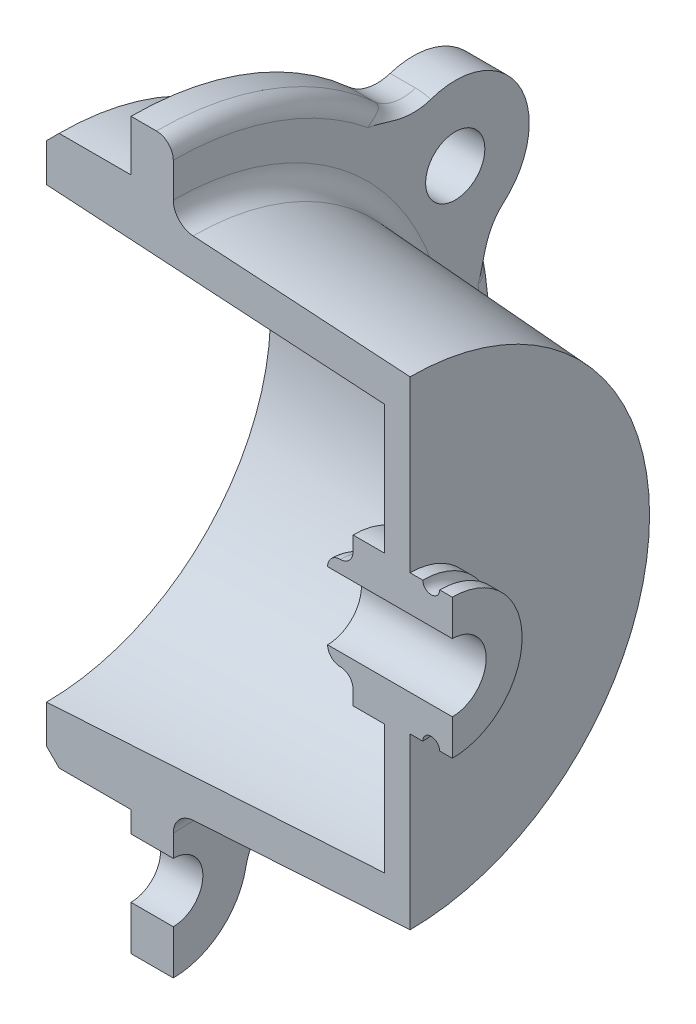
ISO-10303-21;
HEADER;
FILE_DESCRIPTION(('STEP AP214'),'2;1');
FILE_NAME('part.step','',(''),(''),'','','');
FILE_SCHEMA(('AUTOMOTIVE_DESIGN { 1 0 10303 214 1 1 1 1 }'));
ENDSEC;
DATA;
#1=APPLICATION_CONTEXT('core data for automotive mechanical design processes');
#2=APPLICATION_PROTOCOL_DEFINITION('international standard','automotive_design',2000,#1);
#3=PRODUCT_CONTEXT('',#1,'mechanical');
#4=PRODUCT('Part','Part','',(#3));
#5=PRODUCT_RELATED_PRODUCT_CATEGORY('part','',(#4));
#6=PRODUCT_DEFINITION_FORMATION('','',#4);
#7=PRODUCT_DEFINITION_CONTEXT('part definition',#1,'design');
#8=PRODUCT_DEFINITION('design','',#6,#7);
#9=PRODUCT_DEFINITION_SHAPE('','',#8);
#10=(LENGTH_UNIT() NAMED_UNIT(*) SI_UNIT(.MILLI.,.METRE.));
#11=(NAMED_UNIT(*) PLANE_ANGLE_UNIT() SI_UNIT($,.RADIAN.));
#12=(NAMED_UNIT(*) SI_UNIT($,.STERADIAN.) SOLID_ANGLE_UNIT());
#13=UNCERTAINTY_MEASURE_WITH_UNIT(LENGTH_MEASURE(1.E-05),#10,'distance_accuracy_value','');
#14=(GEOMETRIC_REPRESENTATION_CONTEXT(3) GLOBAL_UNCERTAINTY_ASSIGNED_CONTEXT((#13)) GLOBAL_UNIT_ASSIGNED_CONTEXT((#10,
#11,#12)) REPRESENTATION_CONTEXT('',''));
#15=CARTESIAN_POINT('',(0.,0.,0.));
#16=DIRECTION('',(0.,0.,1.));
#17=DIRECTION('',(1.,0.,0.));
#18=AXIS2_PLACEMENT_3D('',#15,#16,#17);
#19=CARTESIAN_POINT('',(-54.,0.,0.));
#20=DIRECTION('',(1.,0.,0.));
#21=DIRECTION('',(0.,0.,-1.));
#22=AXIS2_PLACEMENT_3D('',#19,#20,#21);
#23=TOROIDAL_SURFACE('',#22,73.,4.);
#24=CARTESIAN_POINT('',(-54.,73.,0.));
#25=DIRECTION('',(0.,0.,-1.));
#26=DIRECTION('',(-1.,0.,0.));
#27=AXIS2_PLACEMENT_3D('',#24,#25,#26);
#28=CIRCLE('',#27,4.);
#29=CARTESIAN_POINT('',(-50.,73.,0.));
#30=VERTEX_POINT('',#29);
#31=CARTESIAN_POINT('',(-54.,77.,0.));
#32=VERTEX_POINT('',#31);
#33=EDGE_CURVE('E575',#30,#32,#28,.F.);
#34=ORIENTED_EDGE('',*,*,#33,.F.);
#35=CARTESIAN_POINT('',(-50.,0.,0.));
#36=DIRECTION('',(1.,0.,0.));
#37=DIRECTION('',(0.,0.,-1.));
#38=AXIS2_PLACEMENT_3D('',#35,#36,#37);
#39=CIRCLE('',#38,73.);
#40=CARTESIAN_POINT('',(-50.,56.6580063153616,-46.0311885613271));
#41=VERTEX_POINT('',#40);
#42=EDGE_CURVE('E288',#41,#30,#39,.T.);
#43=ORIENTED_EDGE('',*,*,#42,.F.);
#44=CARTESIAN_POINT('',(-50.066736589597,56.0810851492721,-45.5873666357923));
#45=CARTESIAN_POINT('',(-49.9711604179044,50.2446800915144,-53.5863218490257));
#46=CARTESIAN_POINT('',(-40.2335780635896,48.7897129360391,-52.5286811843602));
#47=CARTESIAN_POINT('',(-50.0472436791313,56.1756877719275,-45.637853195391));
#48=CARTESIAN_POINT('',(-49.9892880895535,50.2165188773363,-53.5960225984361));
#49=CARTESIAN_POINT('',(-40.1653528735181,48.9796504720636,-52.6666912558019));
#50=CARTESIAN_POINT('',(-50.0319945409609,56.2660511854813,-45.6949882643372));
#51=CARTESIAN_POINT('',(-50.0016808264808,50.1860405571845,-53.5969139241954));
#52=CARTESIAN_POINT('',(-40.1119808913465,49.1681732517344,-52.8096294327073));
#53=CARTESIAN_POINT('',(-50.0100549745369,56.4377545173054,-45.8218315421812));
#54=CARTESIAN_POINT('',(-50.0140244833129,50.1269425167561,-53.5854097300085));
#55=CARTESIAN_POINT('',(-40.0351924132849,49.5407491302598,-53.1042723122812));
#56=CARTESIAN_POINT('',(-50.0033635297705,56.5190955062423,-45.8915382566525));
#57=CARTESIAN_POINT('',(-50.0139418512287,50.0983900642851,-53.5730052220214));
#58=CARTESIAN_POINT('',(-40.0117723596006,49.7248027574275,-53.2559759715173));
#59=CARTESIAN_POINT('',(-49.9986159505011,56.671906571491,-46.04249216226));
#60=CARTESIAN_POINT('',(-50.0003838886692,50.0500005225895,-53.5394287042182));
#61=CARTESIAN_POINT('',(-39.9951558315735,50.086077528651,-53.5664330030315));
#62=CARTESIAN_POINT('',(-50.000523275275,56.7434170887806,-46.1236891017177));
#63=CARTESIAN_POINT('',(-49.9869859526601,50.0301756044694,-53.5183343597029));
#64=CARTESIAN_POINT('',(-40.0018314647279,50.2633243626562,-53.7251537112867));
#65=CARTESIAN_POINT('',(-50.0128193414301,56.876732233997,-46.29673435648));
#66=CARTESIAN_POINT('',(-49.9486492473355,50.0044886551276,-53.4730840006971));
#67=CARTESIAN_POINT('',(-40.0448676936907,50.6104079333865,-54.0489133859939));
#68=CARTESIAN_POINT('',(-50.023207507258,56.9385375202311,-46.388581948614));
#69=CARTESIAN_POINT('',(-49.9237799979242,49.9986165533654,-53.4489824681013));
#70=CARTESIAN_POINT('',(-40.0812262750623,50.7802451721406,-54.2139519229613));
#71=CARTESIAN_POINT('',(-50.0514614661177,57.0491411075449,-46.5760399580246));
#72=CARTESIAN_POINT('',(-49.867667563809,50.004278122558,-53.4047753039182));
#73=CARTESIAN_POINT('',(-40.1801151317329,51.1018034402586,-54.5392525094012));
#74=CARTESIAN_POINT('',(-50.0688622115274,57.0984834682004,-46.6711291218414));
#75=CARTESIAN_POINT('',(-49.8369582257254,50.0147560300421,-53.3845512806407));
#76=CARTESIAN_POINT('',(-40.2410177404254,51.2540045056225,-54.6992423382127));
#77=CARTESIAN_POINT('',(-50.11084991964,57.188706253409,-46.8683641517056));
#78=CARTESIAN_POINT('',(-49.7723971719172,50.0526386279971,-53.3508282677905));
#79=CARTESIAN_POINT('',(-40.3879747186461,51.5500718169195,-55.0223245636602));
#80=CARTESIAN_POINT('',(-50.1354393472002,57.2295837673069,-46.9705124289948));
#81=CARTESIAN_POINT('',(-49.7386094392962,50.0799243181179,-53.3373175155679));
#82=CARTESIAN_POINT('',(-40.4740377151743,51.6939351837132,-55.1854180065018));
#83=CARTESIAN_POINT('',(-50.1915497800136,57.3031621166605,-47.1804937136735));
#84=CARTESIAN_POINT('',(-49.6723299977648,50.15119580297,-53.3204606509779));
#85=CARTESIAN_POINT('',(-40.6704242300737,51.9727033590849,-55.5133435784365));
#86=CARTESIAN_POINT('',(-50.2230712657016,57.3358623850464,-47.2883271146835));
#87=CARTESIAN_POINT('',(-49.6398699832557,50.1950218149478,-53.3170542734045));
#88=CARTESIAN_POINT('',(-40.7807494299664,52.1076075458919,-55.6781758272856));
#89=CARTESIAN_POINT('',(-50.2927702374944,57.393527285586,-47.5083137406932));
#90=CARTESIAN_POINT('',(-49.5806192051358,50.2978626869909,-53.3226887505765));
#91=CARTESIAN_POINT('',(-41.0246958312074,52.3681162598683,-56.00830186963));
#92=CARTESIAN_POINT('',(-50.3309502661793,57.4184889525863,-47.6204686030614));
#93=CARTESIAN_POINT('',(-49.5538140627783,50.3567109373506,-53.3316315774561));
#94=CARTESIAN_POINT('',(-41.1583259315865,52.4937172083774,-56.1735958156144));
#95=CARTESIAN_POINT('',(-50.4158048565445,57.462303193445,-47.8535442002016));
#96=CARTESIAN_POINT('',(-49.5087352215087,50.4905168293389,-53.3639029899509));
#97=CARTESIAN_POINT('',(-41.4553169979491,52.7416291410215,-56.5118279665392));
#98=CARTESIAN_POINT('',(-50.4628169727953,57.4807723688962,-47.9746180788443));
#99=CARTESIAN_POINT('',(-49.4908866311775,50.5660010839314,-53.3878118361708));
#100=CARTESIAN_POINT('',(-41.6198594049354,52.8634327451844,-56.6847186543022));
#101=CARTESIAN_POINT('',(-50.5635147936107,57.510458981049,-48.2183257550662));
#102=CARTESIAN_POINT('',(-49.4696507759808,50.7276429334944,-53.4505873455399));
#103=CARTESIAN_POINT('',(-41.9723017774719,53.0964392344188,-57.0280208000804));
#104=CARTESIAN_POINT('',(-50.6172029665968,57.5216737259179,-48.340960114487));
#105=CARTESIAN_POINT('',(-49.4661331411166,50.8136563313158,-53.4892962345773));
#106=CARTESIAN_POINT('',(-42.1602103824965,53.2076381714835,-57.1984313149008));
#107=CARTESIAN_POINT('',(-50.7877867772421,57.5456085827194,-48.7087949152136));
#108=CARTESIAN_POINT('',(-49.4818163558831,51.0809348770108,-53.6257872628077));
#109=CARTESIAN_POINT('',(-42.7572537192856,53.5254357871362,-57.7037425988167));
#110=CARTESIAN_POINT('',(-50.9142370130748,57.5486360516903,-48.9540251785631));
#111=CARTESIAN_POINT('',(-49.5263248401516,51.2736220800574,-53.7444054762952));
#112=CARTESIAN_POINT('',(-43.1998295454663,53.7163368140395,-58.0328640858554));
#113=CARTESIAN_POINT('',(-51.2032990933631,57.5352533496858,-49.4547720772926));
#114=CARTESIAN_POINT('',(-49.7073390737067,51.6780291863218,-54.0332274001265));
#115=CARTESIAN_POINT('',(-44.2115468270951,54.0746255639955,-58.6941973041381));
#116=CARTESIAN_POINT('',(-51.368236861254,57.5169153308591,-49.708953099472));
#117=CARTESIAN_POINT('',(-49.8505914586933,51.8903234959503,-54.2067948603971));
#118=CARTESIAN_POINT('',(-44.7888290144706,54.2378941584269,-59.0235697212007));
#119=CARTESIAN_POINT('',(-51.7226045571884,57.4678535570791,-50.1853263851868));
#120=CARTESIAN_POINT('',(-50.2386639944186,52.2874806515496,-54.5665352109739));
#121=CARTESIAN_POINT('',(-46.0291159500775,54.5204545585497,-59.6335543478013));
#122=CARTESIAN_POINT('',(-51.9120525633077,57.4371206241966,-50.4074947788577));
#123=CARTESIAN_POINT('',(-50.4820760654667,52.4733490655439,-54.7529214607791));
#124=CARTESIAN_POINT('',(-46.6921839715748,54.6397136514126,-59.9141302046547));
#125=CARTESIAN_POINT('',(-52.2139605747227,57.3894952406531,-50.7060501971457));
#126=CARTESIAN_POINT('',(-50.9182141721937,52.7203801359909,-55.0178266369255));
#127=CARTESIAN_POINT('',(-47.7488620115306,54.7899970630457,-60.2882743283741));
#128=CARTESIAN_POINT('',(-52.3189846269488,57.3731510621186,-50.8007426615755));
#129=CARTESIAN_POINT('',(-51.0769749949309,52.7979822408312,-55.1043629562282));
#130=CARTESIAN_POINT('',(-48.1164461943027,54.8357076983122,-60.406373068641));
#131=CARTESIAN_POINT('',(-52.5337698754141,57.3414892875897,-50.9749063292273));
#132=CARTESIAN_POINT('',(-51.4145745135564,52.9396117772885,-55.2668037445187));
#133=CARTESIAN_POINT('',(-48.8681945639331,54.91726631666,-60.6228725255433));
#134=CARTESIAN_POINT('',(-52.6435286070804,57.3261711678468,-51.0543853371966));
#135=CARTESIAN_POINT('',(-51.5934679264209,53.0038251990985,-55.3428849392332));
#136=CARTESIAN_POINT('',(-49.2523501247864,54.9531193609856,-60.7212833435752));
#137=CARTESIAN_POINT('',(-52.866761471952,57.2979228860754,-51.195859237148));
#138=CARTESIAN_POINT('',(-51.9675163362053,53.1172523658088,-55.4802007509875));
#139=CARTESIAN_POINT('',(-50.0336651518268,55.015403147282,-60.8960321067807));
#140=CARTESIAN_POINT('',(-52.9802262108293,57.2849871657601,-51.2578950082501));
#141=CARTESIAN_POINT('',(-52.1627923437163,53.1666600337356,-55.5416440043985));
#142=CARTESIAN_POINT('',(-50.4307917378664,55.0418559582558,-60.9724216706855));
#143=CARTESIAN_POINT('',(-53.2101250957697,57.2626060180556,-51.362881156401));
#144=CARTESIAN_POINT('',(-52.5657296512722,53.2497430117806,-55.6464770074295));
#145=CARTESIAN_POINT('',(-51.2354378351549,55.0858606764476,-61.1014925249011));
#146=CARTESIAN_POINT('',(-53.3265571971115,57.2531582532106,-51.4058443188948));
#147=CARTESIAN_POINT('',(-52.7736309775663,53.2835547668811,-55.6900303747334));
#148=CARTESIAN_POINT('',(-51.6429501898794,55.1034185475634,-61.1541896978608));
#149=CARTESIAN_POINT('',(-53.5358492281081,57.2401684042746,-51.464261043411));
#150=CARTESIAN_POINT('',(-53.1512852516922,53.32934114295,-55.7494654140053));
#151=CARTESIAN_POINT('',(-52.375472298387,55.1270683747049,-61.2257818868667));
#152=CARTESIAN_POINT('',(-53.6283425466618,57.2357897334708,-51.4836608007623));
#153=CARTESIAN_POINT('',(-53.3196190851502,53.344497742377,-55.7693460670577));
#154=CARTESIAN_POINT('',(-52.6991989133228,55.1348215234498,-61.2495301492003));
#155=CARTESIAN_POINT('',(-53.8138894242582,57.2299244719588,-51.5095650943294));
#156=CARTESIAN_POINT('',(-53.6585514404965,53.3646996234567,-55.7959035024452));
#157=CARTESIAN_POINT('',(-53.3486129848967,55.1451455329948,-61.2812332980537));
#158=CARTESIAN_POINT('',(-53.9069426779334,57.2284364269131,-51.5160761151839));
#159=CARTESIAN_POINT('',(-53.8293152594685,53.369770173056,-55.8026133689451));
#160=CARTESIAN_POINT('',(-53.6742993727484,55.1477189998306,-61.2891961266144));
#161=CARTESIAN_POINT('',(-54.1036526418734,57.2284376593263,-51.5160740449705));
#162=CARTESIAN_POINT('',(-54.1901185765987,53.3697685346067,-55.8026088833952));
#163=CARTESIAN_POINT('',(-54.3627842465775,55.1477193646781,-61.289193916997));
#164=CARTESIAN_POINT('',(-54.2073103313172,57.23028521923,-51.5079936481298));
#165=CARTESIAN_POINT('',(-54.3803645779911,53.3634753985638,-55.7942785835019));
#166=CARTESIAN_POINT('',(-54.7255861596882,55.1445269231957,-61.2793121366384));
#167=CARTESIAN_POINT('',(-54.4138597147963,57.2375461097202,-51.4758754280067));
#168=CARTESIAN_POINT('',(-54.757286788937,53.3384180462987,-55.7613739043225));
#169=CARTESIAN_POINT('',(-55.4485090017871,55.1317087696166,-61.2399993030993));
#170=CARTESIAN_POINT('',(-54.5167508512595,57.2429618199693,-51.4518269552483));
#171=CARTESIAN_POINT('',(-54.944189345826,53.3196144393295,-55.7367480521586));
#172=CARTESIAN_POINT('',(-55.808627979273,55.1220787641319,-61.2105552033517));
#173=CARTESIAN_POINT('',(-54.7215088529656,57.2570338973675,-51.3881729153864));
#174=CARTESIAN_POINT('',(-55.3120594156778,53.2696614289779,-55.6721661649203));
#175=CARTESIAN_POINT('',(-56.5252809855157,55.0961805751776,-61.1325101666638));
#176=CARTESIAN_POINT('',(-54.8233660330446,57.2657092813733,-51.3484759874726));
#177=CARTESIAN_POINT('',(-55.4931884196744,53.2383788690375,-55.6320433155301));
#178=CARTESIAN_POINT('',(-56.8817811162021,55.07987338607,-61.0837967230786));
#179=CARTESIAN_POINT('',(-55.02464303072,57.2856536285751,-51.254591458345));
#180=CARTESIAN_POINT('',(-55.8452724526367,53.1640395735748,-55.5384491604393));
#181=CARTESIAN_POINT('',(-57.5862506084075,55.0404121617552,-60.9683439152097));
#182=CARTESIAN_POINT('',(-55.1240647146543,57.2969205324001,-51.2004153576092));
#183=CARTESIAN_POINT('',(-56.0164006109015,53.1209060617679,-55.4848854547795));
#184=CARTESIAN_POINT('',(-57.9342265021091,55.0172635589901,-60.901618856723));
#185=CARTESIAN_POINT('',(-55.2219557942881,57.3091690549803,-51.1394975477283));
#186=CARTESIAN_POINT('',(-56.1805461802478,53.072216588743,-55.4257033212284));
#187=CARTESIAN_POINT('',(-58.2768452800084,54.990578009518,-60.8264107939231));
#188=(BOUNDED_SURFACE() B_SPLINE_SURFACE(3,2,((#44,#45,#46),(#47,#48,#49),(#50,#51,#52),(#53,
#54,#55),(#56,#57,#58),(#59,#60,#61),(#62,#63,#64),(#65,#66,#67),(#68,#69,#70),(#71,#72,#73),
(#74,#75,#76),(#77,#78,#79),(#80,#81,#82),(#83,#84,#85),(#86,#87,#88),(#89,#90,#91),(#92,#93,
#94),(#95,#96,#97),(#98,#99,#100),(#101,#102,#103),(#104,#105,#106),(#107,#108,#109),(#110,#111,
#112),(#113,#114,#115),(#116,#117,#118),(#119,#120,#121),(#122,#123,#124),(#125,#126,#127),
(#128,#129,#130),(#131,#132,#133),(#134,#135,#136),(#137,#138,#139),(#140,#141,#142),(#143,#144,
#145),(#146,#147,#148),(#149,#150,#151),(#152,#153,#154),(#155,#156,#157),(#158,#159,#160),
(#161,#162,#163),(#164,#165,#166),(#167,#168,#169),(#170,#171,#172),(#173,#174,#175),(#176,#177,
#178),(#179,#180,#181),(#182,#183,#184),(#185,#186,#187)),.UNSPECIFIED.,.F.,.F.,
.F.) B_SPLINE_SURFACE_WITH_KNOTS((4,2,2,2,2,2,2,2,2,2,2,2,2,2,2,2,2,2,2,2,2,2,2,4),(3,3),(0.,
1.12523682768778,2.25033998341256,3.37066649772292,4.49091698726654,5.5466577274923,
6.60276088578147,7.65893726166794,8.71551782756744,9.82682552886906,10.9385453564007,
13.1610954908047,15.6007768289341,18.0422679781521,19.2948002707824,20.5466882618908,
21.7956174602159,23.0437081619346,24.0210048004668,24.9978096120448,26.0858314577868,
27.1745796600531,28.2697807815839,29.3641145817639),(0.,1.),
.UNSPECIFIED.) GEOMETRIC_REPRESENTATION_ITEM() RATIONAL_B_SPLINE_SURFACE(((1.,0.710568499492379,
1.),(1.,0.709187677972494,1.),(1.,0.708189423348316,1.),(1.,0.706961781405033,1.),(1.,
0.706732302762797,1.),(1.,0.707044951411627,1.),(1.,0.707583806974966,1.),(1.,0.70939151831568,
1.),(1.,0.710660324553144,1.),(1.,0.71377509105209,1.),(1.,0.715583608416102,1.),(1.,
0.719728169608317,1.),(1.,0.722064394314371,1.),(1.,0.727185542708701,1.),(1.,0.729970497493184,
1.),(1.,0.73590536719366,1.),(1.,0.739055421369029,1.),(1.,0.745804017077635,1.),(1.,
0.749417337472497,1.),(1.,0.756853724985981,1.),(1.,0.760676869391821,1.),(1.,0.772319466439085,
1.),(1.,0.780315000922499,1.),(1.,0.796854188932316,1.),(1.,0.805375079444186,1.),(1.,
0.821403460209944,1.),(1.,0.828910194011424,1.),(1.,0.838990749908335,1.),(1.,0.842186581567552,
1.),(1.,0.848060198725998,1.),(1.,0.850738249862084,1.),(1.,0.855500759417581,1.),(1.,
0.857586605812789,1.),(1.,0.861113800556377,1.),(1.,0.862555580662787,1.),(1.,0.864515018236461,
1.),(1.,0.865165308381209,1.),(1.,0.866033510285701,1.),(1.,0.866251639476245,1.),(1.,
0.866251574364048,1.),(1.,0.865980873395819,1.),(1.,0.864904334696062,1.),(1.,0.864098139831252,
1.),(1.,0.861962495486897,1.),(1.,0.860629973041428,1.),(1.,0.857475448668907,1.),(1.,
0.855653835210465,1.),(1.,0.85360338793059,1.))) REPRESENTATION_ITEM('') SURFACE());
#189=CARTESIAN_POINT('',(-50.066736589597,56.0810851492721,-45.5873666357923));
#190=CARTESIAN_POINT('',(-50.0472436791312,56.1756877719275,-45.637853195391));
#191=CARTESIAN_POINT('',(-50.0319945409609,56.2660511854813,-45.6949882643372));
#192=CARTESIAN_POINT('',(-50.0100549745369,56.4377545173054,-45.8218315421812));
#193=CARTESIAN_POINT('',(-50.0033635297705,56.5190955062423,-45.8915382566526));
#194=CARTESIAN_POINT('',(-49.9986159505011,56.671906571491,-46.04249216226));
#195=CARTESIAN_POINT('',(-50.000523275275,56.7434170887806,-46.1236891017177));
#196=CARTESIAN_POINT('',(-50.0128193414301,56.876732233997,-46.29673435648));
#197=CARTESIAN_POINT('',(-50.023207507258,56.9385375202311,-46.388581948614));
#198=CARTESIAN_POINT('',(-50.0514614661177,57.0491411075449,-46.5760399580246));
#199=CARTESIAN_POINT('',(-50.0688622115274,57.0984834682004,-46.6711291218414));
#200=CARTESIAN_POINT('',(-50.11084991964,57.188706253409,-46.8683641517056));
#201=CARTESIAN_POINT('',(-50.1354393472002,57.2295837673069,-46.9705124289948));
#202=CARTESIAN_POINT('',(-50.1915497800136,57.3031621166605,-47.1804937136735));
#203=CARTESIAN_POINT('',(-50.2230712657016,57.3358623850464,-47.2883271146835));
#204=CARTESIAN_POINT('',(-50.2927702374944,57.393527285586,-47.5083137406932));
#205=CARTESIAN_POINT('',(-50.3309502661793,57.4184889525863,-47.6204686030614));
#206=CARTESIAN_POINT('',(-50.4158048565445,57.462303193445,-47.8535442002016));
#207=CARTESIAN_POINT('',(-50.4628169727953,57.4807723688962,-47.9746180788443));
#208=CARTESIAN_POINT('',(-50.5635147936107,57.510458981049,-48.2183257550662));
#209=CARTESIAN_POINT('',(-50.6172029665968,57.5216737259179,-48.340960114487));
#210=CARTESIAN_POINT('',(-50.7877867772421,57.5456085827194,-48.7087949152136));
#211=CARTESIAN_POINT('',(-50.9142370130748,57.5486360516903,-48.9540251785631));
#212=CARTESIAN_POINT('',(-51.2032990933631,57.5352533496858,-49.4547720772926));
#213=CARTESIAN_POINT('',(-51.368236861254,57.516915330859,-49.708953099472));
#214=CARTESIAN_POINT('',(-51.7226045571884,57.4678535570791,-50.1853263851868));
#215=CARTESIAN_POINT('',(-51.9120525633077,57.4371206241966,-50.4074947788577));
#216=CARTESIAN_POINT('',(-52.2139605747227,57.3894952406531,-50.7060501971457));
#217=CARTESIAN_POINT('',(-52.3189846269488,57.3731510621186,-50.8007426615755));
#218=CARTESIAN_POINT('',(-52.5337698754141,57.3414892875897,-50.9749063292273));
#219=CARTESIAN_POINT('',(-52.6435286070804,57.3261711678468,-51.0543853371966));
#220=CARTESIAN_POINT('',(-52.866761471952,57.2979228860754,-51.195859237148));
#221=CARTESIAN_POINT('',(-52.9802262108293,57.2849871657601,-51.2578950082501));
#222=CARTESIAN_POINT('',(-53.2101250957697,57.2626060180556,-51.362881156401));
#223=CARTESIAN_POINT('',(-53.3265571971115,57.2531582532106,-51.4058443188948));
#224=CARTESIAN_POINT('',(-53.5358492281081,57.2401684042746,-51.464261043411));
#225=CARTESIAN_POINT('',(-53.6283425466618,57.2357897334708,-51.4836608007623));
#226=CARTESIAN_POINT('',(-53.8138894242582,57.2299244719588,-51.5095650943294));
#227=CARTESIAN_POINT('',(-53.9069426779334,57.2284364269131,-51.5160761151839));
#228=CARTESIAN_POINT('',(-54.1036526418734,57.2284376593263,-51.5160740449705));
#229=CARTESIAN_POINT('',(-54.2073103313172,57.23028521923,-51.5079936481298));
#230=CARTESIAN_POINT('',(-54.4138597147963,57.2375461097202,-51.4758754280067));
#231=CARTESIAN_POINT('',(-54.5167508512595,57.2429618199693,-51.4518269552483));
#232=CARTESIAN_POINT('',(-54.7215088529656,57.2570338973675,-51.3881729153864));
#233=CARTESIAN_POINT('',(-54.8233660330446,57.2657092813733,-51.3484759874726));
#234=CARTESIAN_POINT('',(-55.02464303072,57.2856536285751,-51.254591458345));
#235=CARTESIAN_POINT('',(-55.1240647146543,57.2969205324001,-51.2004153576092));
#236=CARTESIAN_POINT('',(-55.2219557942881,57.3091690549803,-51.1394975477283));
#237=B_SPLINE_CURVE_WITH_KNOTS('',3,(#189,#190,#191,#192,#193,#194,#195,#196,#197,#198,#199,
#200,#201,#202,#203,#204,#205,#206,#207,#208,#209,#210,#211,#212,#213,#214,#215,#216,#217,#218,
#219,#220,#221,#222,#223,#224,#225,#226,#227,#228,#229,#230,#231,#232,#233,#234,#235,#236),
.UNSPECIFIED.,.F.,.F.,(4,2,2,2,2,2,2,2,2,2,2,2,2,2,2,2,2,2,2,2,2,2,2,4),(0.,1.12523682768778,
2.25033998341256,3.37066649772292,4.49091698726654,5.5466577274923,6.60276088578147,
7.65893726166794,8.71551782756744,9.82682552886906,10.9385453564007,13.1610954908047,
15.6007768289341,18.0422679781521,19.2948002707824,20.5466882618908,21.7956174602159,
23.0437081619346,24.0210048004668,24.9978096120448,26.0858314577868,27.1745796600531,
28.2697807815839,29.3641145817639),.UNSPECIFIED.);
#238=CARTESIAN_POINT('',(-54.,57.2284370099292,-51.5160751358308));
#239=VERTEX_POINT('',#238);
#240=EDGE_CURVE('E542',#41,#239,#237,.T.);
#241=ORIENTED_EDGE('',*,*,#240,.T.);
#242=CARTESIAN_POINT('',(-54.,0.,0.));
#243=DIRECTION('',(1.,0.,0.));
#244=DIRECTION('',(0.,0.,-1.));
#245=AXIS2_PLACEMENT_3D('',#242,#243,#244);
#246=CIRCLE('',#245,77.);
#247=EDGE_CURVE('E293',#32,#239,#246,.F.);
#248=ORIENTED_EDGE('',*,*,#247,.F.);
#249=EDGE_LOOP('',(#34,#43,#241,#248));
#250=FACE_BOUND('',#249,.T.);
#251=ADVANCED_FACE('F24',(#250),#23,.T.);
#252=CARTESIAN_POINT('',(80.,0.,0.));
#253=DIRECTION('',(1.,0.,0.));
#254=DIRECTION('',(0.,0.,-1.));
#255=AXIS2_PLACEMENT_3D('',#252,#253,#254);
#256=CYLINDRICAL_SURFACE('',#255,77.);
#257=DIRECTION('',(1.,0.,0.));
#258=VECTOR('',#257,1.);
#259=CARTESIAN_POINT('',(80.,77.,0.));
#260=LINE('',#259,#258);
#261=CARTESIAN_POINT('',(-60.,77.,0.));
#262=VERTEX_POINT('',#261);
#263=EDGE_CURVE('E614',#32,#262,#260,.F.);
#264=ORIENTED_EDGE('',*,*,#263,.F.);
#265=ORIENTED_EDGE('',*,*,#247,.T.);
#266=DIRECTION('',(1.,0.,0.));
#267=VECTOR('',#266,1.);
#268=CARTESIAN_POINT('',(80.,57.2284370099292,-51.5160751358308));
#269=LINE('',#268,#267);
#270=CARTESIAN_POINT('',(-60.,57.2284370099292,-51.5160751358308));
#271=VERTEX_POINT('',#270);
#272=EDGE_CURVE('E539',#239,#271,#269,.F.);
#273=ORIENTED_EDGE('',*,*,#272,.T.);
#274=CARTESIAN_POINT('',(-60.,0.,0.));
#275=DIRECTION('',(1.,0.,0.));
#276=DIRECTION('',(0.,0.,-1.));
#277=AXIS2_PLACEMENT_3D('',#274,#275,#276);
#278=CIRCLE('',#277,77.);
#279=EDGE_CURVE('E259',#271,#262,#278,.T.);
#280=ORIENTED_EDGE('',*,*,#279,.T.);
#281=EDGE_LOOP('',(#264,#265,#273,#280));
#282=FACE_BOUND('',#281,.T.);
#283=ADVANCED_FACE('F655',(#282),#256,.T.);
#284=CARTESIAN_POINT('',(16.,0.,0.));
#285=DIRECTION('',(-1.,0.,0.));
#286=DIRECTION('',(0.,0.,1.));
#287=AXIS2_PLACEMENT_3D('',#284,#285,#286);
#288=CYLINDRICAL_SURFACE('',#287,16.5);
#289=CARTESIAN_POINT('',(16.,0.,0.));
#290=DIRECTION('',(1.,0.,0.));
#291=DIRECTION('',(0.,0.,-1.));
#292=AXIS2_PLACEMENT_3D('',#289,#290,#291);
#293=CIRCLE('',#292,16.5);
#294=CARTESIAN_POINT('',(16.,-16.5,0.));
#295=VERTEX_POINT('',#294);
#296=CARTESIAN_POINT('',(16.,16.5,0.));
#297=VERTEX_POINT('',#296);
#298=EDGE_CURVE('E248',#295,#297,#293,.T.);
#299=ORIENTED_EDGE('',*,*,#298,.F.);
#300=DIRECTION('',(-1.,0.,0.));
#301=VECTOR('',#300,1.);
#302=CARTESIAN_POINT('',(16.,-16.5,0.));
#303=LINE('',#302,#301);
#304=CARTESIAN_POINT('',(12.99999975,-16.5,0.));
#305=VERTEX_POINT('',#304);
#306=EDGE_CURVE('E230',#295,#305,#303,.T.);
#307=ORIENTED_EDGE('',*,*,#306,.T.);
#308=CARTESIAN_POINT('',(12.99999975,0.,0.));
#309=DIRECTION('',(-1.,0.,0.));
#310=DIRECTION('',(0.,0.,1.));
#311=AXIS2_PLACEMENT_3D('',#308,#309,#310);
#312=CIRCLE('',#311,16.5);
#313=CARTESIAN_POINT('',(12.99999975,16.5,0.));
#314=VERTEX_POINT('',#313);
#315=EDGE_CURVE('E305',#305,#314,#312,.F.);
#316=ORIENTED_EDGE('',*,*,#315,.T.);
#317=DIRECTION('',(-1.,0.,0.));
#318=VECTOR('',#317,1.);
#319=CARTESIAN_POINT('',(16.,16.5,0.));
#320=LINE('',#319,#318);
#321=EDGE_CURVE('E40',#314,#297,#320,.F.);
#322=ORIENTED_EDGE('',*,*,#321,.T.);
#323=EDGE_LOOP('',(#299,#307,#316,#322));
#324=FACE_BOUND('',#323,.T.);
#325=ADVANCED_FACE('F254',(#324),#288,.T.);
#326=CARTESIAN_POINT('',(0.,0.,0.));
#327=DIRECTION('',(-1.,0.,0.));
#328=DIRECTION('',(0.,0.,1.));
#329=AXIS2_PLACEMENT_3D('',#326,#327,#328);
#330=PLANE('',#329);
#331=DIRECTION('',(0.,-1.,0.));
#332=VECTOR('',#331,1.);
#333=CARTESIAN_POINT('',(0.,0.,0.));
#334=LINE('',#333,#332);
#335=CARTESIAN_POINT('',(0.,48.,0.));
#336=VERTEX_POINT('',#335);
#337=CARTESIAN_POINT('',(0.,17.5,0.));
#338=VERTEX_POINT('',#337);
#339=EDGE_CURVE('E379',#336,#338,#334,.T.);
#340=ORIENTED_EDGE('',*,*,#339,.F.);
#341=CARTESIAN_POINT('',(0.,0.,0.));
#342=DIRECTION('',(1.,0.,0.));
#343=DIRECTION('',(0.,0.,-1.));
#344=AXIS2_PLACEMENT_3D('',#341,#342,#343);
#345=CIRCLE('',#344,48.);
#346=CARTESIAN_POINT('',(0.,-48.,0.));
#347=VERTEX_POINT('',#346);
#348=EDGE_CURVE('E276',#347,#336,#345,.T.);
#349=ORIENTED_EDGE('',*,*,#348,.F.);
#350=CARTESIAN_POINT('',(0.,-17.5,0.));
#351=VERTEX_POINT('',#350);
#352=EDGE_CURVE('E380',#351,#347,#334,.T.);
#353=ORIENTED_EDGE('',*,*,#352,.F.);
#354=CARTESIAN_POINT('',(0.,0.,0.));
#355=DIRECTION('',(-1.,0.,0.));
#356=DIRECTION('',(0.,0.,1.));
#357=AXIS2_PLACEMENT_3D('',#354,#355,#356);
#358=CIRCLE('',#357,17.5);
#359=EDGE_CURVE('E262',#338,#351,#358,.T.);
#360=ORIENTED_EDGE('',*,*,#359,.F.);
#361=EDGE_LOOP('',(#340,#349,#353,#360));
#362=FACE_BOUND('',#361,.T.);
#363=ADVANCED_FACE('F377',(#362),#330,.T.);
#364=CARTESIAN_POINT('',(-80.,0.,0.));
#365=DIRECTION('',(-1.,0.,0.));
#366=DIRECTION('',(0.,0.,1.));
#367=AXIS2_PLACEMENT_3D('',#364,#365,#366);
#368=CONICAL_SURFACE('',#367,53.,0.0624188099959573);
#369=DIRECTION('',(-0.998052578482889,-0.0623782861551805,0.));
#370=VECTOR('',#369,1.);
#371=CARTESIAN_POINT('',(768.000000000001,0.,0.));
#372=LINE('',#371,#370);
#373=CARTESIAN_POINT('',(-80.,-53.,0.));
#374=VERTEX_POINT('',#373);
#375=EDGE_CURVE('E382',#347,#374,#372,.T.);
#376=ORIENTED_EDGE('',*,*,#375,.F.);
#377=ORIENTED_EDGE('',*,*,#348,.T.);
#378=DIRECTION('',(0.998052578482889,-0.0623782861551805,0.));
#379=VECTOR('',#378,1.);
#380=CARTESIAN_POINT('',(768.000000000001,0.,0.));
#381=LINE('',#380,#379);
#382=CARTESIAN_POINT('',(-80.,53.,0.));
#383=VERTEX_POINT('',#382);
#384=EDGE_CURVE('E388',#383,#336,#381,.T.);
#385=ORIENTED_EDGE('',*,*,#384,.F.);
#386=CARTESIAN_POINT('',(-80.,0.,0.));
#387=DIRECTION('',(1.,0.,0.));
#388=DIRECTION('',(0.,0.,-1.));
#389=AXIS2_PLACEMENT_3D('',#386,#387,#388);
#390=CIRCLE('',#389,53.);
#391=EDGE_CURVE('E273',#374,#383,#390,.T.);
#392=ORIENTED_EDGE('',*,*,#391,.F.);
#393=EDGE_LOOP('',(#376,#377,#385,#392));
#394=FACE_BOUND('',#393,.T.);
#395=ADVANCED_FACE('F689',(#394),#368,.F.);
#396=CARTESIAN_POINT('',(-80.,53.,0.));
#397=DIRECTION('',(-1.,0.,0.));
#398=DIRECTION('',(0.,0.,1.));
#399=AXIS2_PLACEMENT_3D('',#396,#397,#398);
#400=PLANE('',#399);
#401=DIRECTION('',(0.,1.,0.));
#402=VECTOR('',#401,1.);
#403=CARTESIAN_POINT('',(-80.,80.,0.));
#404=LINE('',#403,#402);
#405=CARTESIAN_POINT('',(-80.,62.,0.));
#406=VERTEX_POINT('',#405);
#407=EDGE_CURVE('E251',#383,#406,#404,.T.);
#408=ORIENTED_EDGE('',*,*,#407,.T.);
#409=CARTESIAN_POINT('',(-80.,0.,0.));
#410=DIRECTION('',(-1.,0.,0.));
#411=DIRECTION('',(0.,0.,1.));
#412=AXIS2_PLACEMENT_3D('',#409,#410,#411);
#413=CIRCLE('',#412,62.);
#414=CARTESIAN_POINT('',(-80.,-62.,0.));
#415=VERTEX_POINT('',#414);
#416=EDGE_CURVE('E298',#406,#415,#413,.T.);
#417=ORIENTED_EDGE('',*,*,#416,.T.);
#418=EDGE_CURVE('E875',#415,#374,#404,.T.);
#419=ORIENTED_EDGE('',*,*,#418,.T.);
#420=ORIENTED_EDGE('',*,*,#391,.T.);
#421=EDGE_LOOP('',(#408,#417,#419,#420));
#422=FACE_BOUND('',#421,.T.);
#423=ADVANCED_FACE('F683',(#422),#400,.T.);
#424=CARTESIAN_POINT('',(80.,0.,0.));
#425=DIRECTION('',(1.,0.,0.));
#426=DIRECTION('',(0.,0.,-1.));
#427=AXIS2_PLACEMENT_3D('',#424,#425,#426);
#428=CYLINDRICAL_SURFACE('',#427,65.);
#429=DIRECTION('',(1.,0.,0.));
#430=VECTOR('',#429,1.);
#431=CARTESIAN_POINT('',(80.,65.,0.));
#432=LINE('',#431,#430);
#433=CARTESIAN_POINT('',(-60.,65.,0.));
#434=VERTEX_POINT('',#433);
#435=CARTESIAN_POINT('',(-77.,65.,0.));
#436=VERTEX_POINT('',#435);
#437=EDGE_CURVE('E617',#434,#436,#432,.F.);
#438=ORIENTED_EDGE('',*,*,#437,.F.);
#439=CARTESIAN_POINT('',(-60.,0.,0.));
#440=DIRECTION('',(1.,0.,0.));
#441=DIRECTION('',(0.,0.,-1.));
#442=AXIS2_PLACEMENT_3D('',#439,#440,#441);
#443=CIRCLE('',#442,65.);
#444=CARTESIAN_POINT('',(-60.,-65.,0.));
#445=VERTEX_POINT('',#444);
#446=EDGE_CURVE('E270',#445,#434,#443,.T.);
#447=ORIENTED_EDGE('',*,*,#446,.F.);
#448=DIRECTION('',(1.,0.,0.));
#449=VECTOR('',#448,1.);
#450=CARTESIAN_POINT('',(80.,-65.,0.));
#451=LINE('',#450,#449);
#452=CARTESIAN_POINT('',(-77.,-65.,0.));
#453=VERTEX_POINT('',#452);
#454=EDGE_CURVE('E595',#453,#445,#451,.T.);
#455=ORIENTED_EDGE('',*,*,#454,.F.);
#456=CARTESIAN_POINT('',(-77.,0.,0.));
#457=DIRECTION('',(-1.,0.,0.));
#458=DIRECTION('',(0.,0.,1.));
#459=AXIS2_PLACEMENT_3D('',#456,#457,#458);
#460=CIRCLE('',#459,65.);
#461=EDGE_CURVE('E295',#453,#436,#460,.F.);
#462=ORIENTED_EDGE('',*,*,#461,.T.);
#463=EDGE_LOOP('',(#438,#447,#455,#462));
#464=FACE_BOUND('',#463,.T.);
#465=ADVANCED_FACE('F679',(#464),#428,.T.);
#466=CARTESIAN_POINT('',(-60.,65.,0.));
#467=DIRECTION('',(-1.,0.,0.));
#468=DIRECTION('',(0.,0.,1.));
#469=AXIS2_PLACEMENT_3D('',#466,#467,#468);
#470=PLANE('',#469);
#471=DIRECTION('',(0.,-1.,0.));
#472=VECTOR('',#471,1.);
#473=CARTESIAN_POINT('',(-60.,65.,0.));
#474=LINE('',#473,#472);
#475=EDGE_CURVE('E616',#262,#434,#474,.T.);
#476=ORIENTED_EDGE('',*,*,#475,.F.);
#477=ORIENTED_EDGE('',*,*,#279,.F.);
#478=CARTESIAN_POINT('',(-60.,64.6607015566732,-58.2064745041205));
#479=DIRECTION('',(-1.,0.,0.));
#480=DIRECTION('',(0.,0.,1.));
#481=AXIS2_PLACEMENT_3D('',#478,#479,#480);
#482=CIRCLE('',#481,10.);
#483=CARTESIAN_POINT('',(-60.,55.1477191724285,-61.2891950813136));
#484=VERTEX_POINT('',#483);
#485=EDGE_CURVE('E501',#271,#484,#482,.F.);
#486=ORIENTED_EDGE('',*,*,#485,.T.);
#487=CARTESIAN_POINT('',(-60.,38.5000000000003,-66.6839560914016));
#488=DIRECTION('',(1.,0.,0.));
#489=DIRECTION('',(0.,0.866025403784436,0.500000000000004));
#490=AXIS2_PLACEMENT_3D('',#487,#488,#489);
#491=CIRCLE('',#490,17.5);
#492=CARTESIAN_POINT('',(-60.,25.5041403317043,-78.4039233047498));
#493=VERTEX_POINT('',#492);
#494=EDGE_CURVE('E448',#493,#484,#491,.T.);
#495=ORIENTED_EDGE('',*,*,#494,.F.);
#496=CARTESIAN_POINT('',(-60.,18.0779348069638,-85.1010474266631));
#497=DIRECTION('',(-1.,0.,0.));
#498=DIRECTION('',(0.,0.,1.));
#499=AXIS2_PLACEMENT_3D('',#496,#497,#498);
#500=CIRCLE('',#499,10.);
#501=CARTESIAN_POINT('',(-60.,16.0000112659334,-75.3193178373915));
#502=VERTEX_POINT('',#501);
#503=EDGE_CURVE('E548',#493,#502,#500,.F.);
#504=ORIENTED_EDGE('',*,*,#503,.T.);
#505=CARTESIAN_POINT('',(-60.,-73.2284482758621,-23.8032427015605));
#506=VERTEX_POINT('',#505);
#507=EDGE_CURVE('E267',#506,#502,#278,.T.);
#508=ORIENTED_EDGE('',*,*,#507,.F.);
#509=CARTESIAN_POINT('',(-60.,-82.7386363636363,-26.8945729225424));
#510=DIRECTION('',(-1.,0.,0.));
#511=DIRECTION('',(0.,0.,1.));
#512=AXIS2_PLACEMENT_3D('',#509,#510,#511);
#513=CIRCLE('',#512,10.);
#514=CARTESIAN_POINT('',(-60.,-80.6518595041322,-17.1147282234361));
#515=VERTEX_POINT('',#514);
#516=EDGE_CURVE('E474',#506,#515,#513,.F.);
#517=ORIENTED_EDGE('',*,*,#516,.T.);
#518=CARTESIAN_POINT('',(-60.,-77.,0.));
#519=DIRECTION('',(1.,0.,0.));
#520=DIRECTION('',(0.,0.,-1.));
#521=AXIS2_PLACEMENT_3D('',#518,#519,#520);
#522=CIRCLE('',#521,17.5);
#523=CARTESIAN_POINT('',(-60.,-94.5,0.));
#524=VERTEX_POINT('',#523);
#525=EDGE_CURVE('E306',#524,#515,#522,.T.);
#526=ORIENTED_EDGE('',*,*,#525,.F.);
#527=CARTESIAN_POINT('',(-60.,-84.,0.));
#528=VERTEX_POINT('',#527);
#529=EDGE_CURVE('E872',#528,#524,#474,.T.);
#530=ORIENTED_EDGE('',*,*,#529,.F.);
#531=CARTESIAN_POINT('',(-60.,-77.,0.));
#532=DIRECTION('',(-1.,0.,0.));
#533=DIRECTION('',(0.,0.,1.));
#534=AXIS2_PLACEMENT_3D('',#531,#532,#533);
#535=CIRCLE('',#534,7.);
#536=CARTESIAN_POINT('',(-60.,-70.,0.));
#537=VERTEX_POINT('',#536);
#538=EDGE_CURVE('E406',#537,#528,#535,.T.);
#539=ORIENTED_EDGE('',*,*,#538,.F.);
#540=EDGE_CURVE('E877',#445,#537,#474,.T.);
#541=ORIENTED_EDGE('',*,*,#540,.F.);
#542=ORIENTED_EDGE('',*,*,#446,.T.);
#543=EDGE_LOOP('',(#476,#477,#486,#495,#504,#508,#517,#526,#530,#539,#541,#542));
#544=FACE_BOUND('',#543,.T.);
#545=CARTESIAN_POINT('',(-60.,38.5000000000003,-66.6839560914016));
#546=DIRECTION('',(-1.,0.,0.));
#547=DIRECTION('',(0.,0.,1.));
#548=AXIS2_PLACEMENT_3D('',#545,#546,#547);
#549=CIRCLE('',#548,7.);
#550=CARTESIAN_POINT('',(-60.,38.5000000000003,-59.6839560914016));
#551=VERTEX_POINT('',#550);
#552=EDGE_CURVE('E400',#551,#551,#549,.T.);
#553=ORIENTED_EDGE('',*,*,#552,.F.);
#554=EDGE_LOOP('',(#553));
#555=FACE_BOUND('',#554,.T.);
#556=ADVANCED_FACE('F559',(#544,#555),#470,.T.);
#557=ORIENTED_EDGE('',*,*,#507,.T.);
#558=DIRECTION('',(1.,0.,0.));
#559=VECTOR('',#558,1.);
#560=CARTESIAN_POINT('',(80.,16.0000112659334,-75.3193178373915));
#561=LINE('',#560,#559);
#562=CARTESIAN_POINT('',(-54.,16.0000112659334,-75.3193178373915));
#563=VERTEX_POINT('',#562);
#564=EDGE_CURVE('E532',#502,#563,#561,.T.);
#565=ORIENTED_EDGE('',*,*,#564,.T.);
#566=CARTESIAN_POINT('',(-54.,-73.2284482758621,-23.8032427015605));
#567=VERTEX_POINT('',#566);
#568=EDGE_CURVE('E292',#563,#567,#246,.F.);
#569=ORIENTED_EDGE('',*,*,#568,.T.);
#570=DIRECTION('',(1.,0.,0.));
#571=VECTOR('',#570,1.);
#572=CARTESIAN_POINT('',(80.,-73.2284482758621,-23.8032427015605));
#573=LINE('',#572,#571);
#574=EDGE_CURVE('E462',#567,#506,#573,.F.);
#575=ORIENTED_EDGE('',*,*,#574,.T.);
#576=EDGE_LOOP('',(#557,#565,#569,#575));
#577=FACE_BOUND('',#576,.T.);
#578=ADVANCED_FACE('F509',(#577),#256,.T.);
#579=CARTESIAN_POINT('',(-50.,77.,0.));
#580=DIRECTION('',(1.,0.,0.));
#581=DIRECTION('',(0.,0.,-1.));
#582=AXIS2_PLACEMENT_3D('',#579,#580,#581);
#583=PLANE('',#582);
#584=DIRECTION('',(0.,1.,0.));
#585=VECTOR('',#584,1.);
#586=CARTESIAN_POINT('',(-50.,77.,0.));
#587=LINE('',#586,#585);
#588=CARTESIAN_POINT('',(-50.,-94.5,0.));
#589=VERTEX_POINT('',#588);
#590=CARTESIAN_POINT('',(-50.,-84.,0.));
#591=VERTEX_POINT('',#590);
#592=EDGE_CURVE('E48',#589,#591,#587,.T.);
#593=ORIENTED_EDGE('',*,*,#592,.F.);
#594=CARTESIAN_POINT('',(-50.,-77.,0.));
#595=DIRECTION('',(1.,0.,0.));
#596=DIRECTION('',(0.,0.,-1.));
#597=AXIS2_PLACEMENT_3D('',#594,#595,#596);
#598=CIRCLE('',#597,17.5);
#599=CARTESIAN_POINT('',(-50.,-80.2336592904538,-17.1986466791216));
#600=VERTEX_POINT('',#599);
#601=EDGE_CURVE('E355',#589,#600,#598,.T.);
#602=ORIENTED_EDGE('',*,*,#601,.T.);
#603=CARTESIAN_POINT('',(-50.066736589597,-67.5203601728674,-25.7739610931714));
#604=CARTESIAN_POINT('',(-49.9711604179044,-71.5294560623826,-16.7200084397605));
#605=CARTESIAN_POINT('',(-40.2335780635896,-69.8860288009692,-15.9887902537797));
#606=CARTESIAN_POINT('',(-50.0472436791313,-67.6113841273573,-25.8306460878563));
#607=CARTESIAN_POINT('',(-49.9892880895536,-71.5237765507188,-16.6907697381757));
#608=CARTESIAN_POINT('',(-40.1653528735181,-70.1005177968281,-16.0842759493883));
#609=CARTESIAN_POINT('',(-50.0319945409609,-67.7060462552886,-25.8803355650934));
#610=CARTESIAN_POINT('',(-50.0016808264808,-71.5093093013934,-16.6639290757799));
#611=CARTESIAN_POINT('',(-40.1119808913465,-70.3185672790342,-16.1760723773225));
#612=CARTESIAN_POINT('',(-50.0100549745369,-67.9017474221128,-25.9656133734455));
#613=CARTESIAN_POINT('',(-50.0140244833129,-71.4697973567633,-16.6185007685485));
#614=CARTESIAN_POINT('',(-40.0351924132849,-70.760023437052,-16.3514111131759));
#615=CARTESIAN_POINT('',(-50.0033635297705,-68.0027857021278,-26.0012033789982));
#616=CARTESIAN_POINT('',(-50.0139418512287,-71.4447785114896,-16.5999758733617));
#617=CARTESIAN_POINT('',(-40.0117723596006,-70.9834294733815,-16.4349544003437));
#618=CARTESIAN_POINT('',(-49.9986159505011,-68.2099211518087,-26.0580646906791));
#619=CARTESIAN_POINT('',(-50.0003838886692,-71.3915056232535,-16.5748575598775));
#620=CARTESIAN_POINT('',(-39.9951558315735,-71.432930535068,-16.5925990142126));
#621=CARTESIAN_POINT('',(-50.000523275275,-68.3159950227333,-26.0793961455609));
#622=CARTESIAN_POINT('',(-49.98698595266,-71.3633249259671,-16.5682358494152));
#623=CARTESIAN_POINT('',(-40.0018314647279,-71.6590101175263,-16.6667389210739));
#624=CARTESIAN_POINT('',(-50.0128193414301,-68.5325141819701,-26.1083278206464));
#625=CARTESIAN_POINT('',(-49.9486492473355,-71.3112934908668,-16.5686154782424));
#626=CARTESIAN_POINT('',(-40.0448676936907,-72.1129360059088,-16.8054422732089));
#627=CARTESIAN_POINT('',(-50.023207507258,-68.6429591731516,-26.1159289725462));
#628=CARTESIAN_POINT('',(-49.9237799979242,-71.2874849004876,-16.5755808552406));
#629=CARTESIAN_POINT('',(-40.0812262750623,-72.3407821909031,-16.8700063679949));
#630=CARTESIAN_POINT('',(-50.0514614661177,-68.860604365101,-26.1179854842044));
#631=CARTESIAN_POINT('',(-49.867667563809,-71.2520311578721,-16.6025875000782));
#632=CARTESIAN_POINT('',(-40.1801151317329,-72.783279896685,-16.9858337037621));
#633=CARTESIAN_POINT('',(-50.0688622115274,-68.9676251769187,-26.1131726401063));
#634=CARTESIAN_POINT('',(-49.8369582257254,-71.239755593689,-16.6217736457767));
#635=CARTESIAN_POINT('',(-40.2410177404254,-72.9979356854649,-17.0376487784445));
#636=CARTESIAN_POINT('',(-50.11084991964,-69.1835471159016,-26.0926903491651));
#637=CARTESIAN_POINT('',(-49.7723971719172,-71.2294919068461,-16.6714424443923));
#638=CARTESIAN_POINT('',(-40.3879747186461,-73.4257667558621,-17.1325094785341));
#639=CARTESIAN_POINT('',(-50.1354393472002,-69.2924488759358,-26.0770171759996));
#640=CARTESIAN_POINT('',(-49.7386094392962,-71.2314340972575,-16.7018279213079));
#641=CARTESIAN_POINT('',(-40.4740377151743,-73.6389415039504,-17.1755520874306));
#642=CARTESIAN_POINT('',(-50.1915497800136,-69.5110871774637,-26.035747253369));
#643=CARTESIAN_POINT('',(-49.6723299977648,-71.2524713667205,-16.7719792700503));
#644=CARTESIAN_POINT('',(-40.6704242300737,-74.0623174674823,-17.2530096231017));
#645=CARTESIAN_POINT('',(-50.2230712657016,-69.6208237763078,-26.0101498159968));
#646=CARTESIAN_POINT('',(-49.6398699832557,-71.2714343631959,-16.8116368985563));
#647=CARTESIAN_POINT('',(-40.7807494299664,-74.272518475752,-17.2874239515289));
#648=CARTESIAN_POINT('',(-50.2927702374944,-69.8401702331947,-25.9500957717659));
#649=CARTESIAN_POINT('',(-49.5806192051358,-71.3277343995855,-16.897882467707));
#650=CARTESIAN_POINT('',(-41.0246958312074,-74.6886703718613,-17.3479680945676));
#651=CARTESIAN_POINT('',(-50.3309502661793,-69.9497800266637,-25.9156357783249));
#652=CARTESIAN_POINT('',(-49.5538140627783,-71.3649032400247,-16.9443751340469));
#653=CARTESIAN_POINT('',(-41.1583259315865,-74.8946196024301,-17.3740947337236));
#654=CARTESIAN_POINT('',(-50.4158048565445,-70.1735365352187,-25.8370422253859));
#655=CARTESIAN_POINT('',(-49.5087352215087,-71.4597540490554,-17.0441187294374));
#656=CARTESIAN_POINT('',(-41.4553169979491,-75.3114932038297,-17.4196766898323));
#657=CARTESIAN_POINT('',(-50.4628169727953,-70.2876241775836,-25.7925000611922));
#658=CARTESIAN_POINT('',(-49.4908866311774,-71.5182018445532,-17.0975355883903));
#659=CARTESIAN_POINT('',(-41.6198594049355,-75.5221227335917,-17.4387163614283));
#660=CARTESIAN_POINT('',(-50.5635147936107,-70.5135245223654,-25.6963555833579));
#661=CARTESIAN_POINT('',(-49.4696507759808,-71.6533879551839,-17.206133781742));
#662=CARTESIAN_POINT('',(-41.9723017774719,-75.9359343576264,-17.4688548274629));
#663=CARTESIAN_POINT('',(-50.6172029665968,-70.6253363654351,-25.6447506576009));
#664=CARTESIAN_POINT('',(-49.4661331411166,-71.7299175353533,-17.2612691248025));
#665=CARTESIAN_POINT('',(-42.1602103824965,-76.1391136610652,-17.4799506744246));
#666=CARTESIAN_POINT('',(-50.7877867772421,-70.9558580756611,-25.4815614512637));
#667=CARTESIAN_POINT('',(-49.4818163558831,-71.9817615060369,-17.4244936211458));
#668=CARTESIAN_POINT('',(-42.7572537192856,-76.7356248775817,-17.502515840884));
#669=CARTESIAN_POINT('',(-50.9142370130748,-71.169747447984,-25.3615681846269));
#670=CARTESIAN_POINT('',(-49.5263248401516,-72.1808314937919,-17.5320565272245));
#671=CARTESIAN_POINT('',(-43.1998295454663,-77.1161029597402,-17.5032802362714));
#672=CARTESIAN_POINT('',(-51.2032990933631,-71.5967156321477,-25.099604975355));
#673=CARTESIAN_POINT('',(-49.7073390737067,-72.633162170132,-17.7378723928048));
#674=CARTESIAN_POINT('',(-44.2115468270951,-77.8679787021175,-17.4829007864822));
#675=CARTESIAN_POINT('',(-51.368236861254,-71.8076738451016,-24.9566332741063));
#676=CARTESIAN_POINT('',(-49.8505914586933,-72.8896231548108,-17.8349409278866));
#677=CARTESIAN_POINT('',(-44.7888290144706,-78.2348578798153,-17.4596093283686));
#678=CARTESIAN_POINT('',(-51.7226045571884,-72.1956943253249,-24.6759578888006));
#679=CARTESIAN_POINT('',(-50.2386639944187,-73.3997460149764,-17.999018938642));
#680=CARTESIAN_POINT('',(-46.0291159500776,-78.9044002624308,-17.3993214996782));
#681=CARTESIAN_POINT('',(-51.9120525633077,-72.3727313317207,-24.5382581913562));
#682=CARTESIAN_POINT('',(-50.4820760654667,-73.6540954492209,-18.0667925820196));
#683=CARTESIAN_POINT('',(-46.6921839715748,-79.2070156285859,-17.362314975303));
#684=CARTESIAN_POINT('',(-52.2139605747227,-72.6074752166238,-24.3477356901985));
#685=CARTESIAN_POINT('',(-50.9182141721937,-74.0070255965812,-18.1482751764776));
#686=CARTESIAN_POINT('',(-47.7488620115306,-79.6061756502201,-17.3053921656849));
#687=CARTESIAN_POINT('',(-52.3189846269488,-72.6813092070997,-24.2862349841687));
#688=CARTESIAN_POINT('',(-51.0769749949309,-74.1207692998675,-18.172212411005));
#689=CARTESIAN_POINT('',(-48.1164461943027,-79.7313074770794,-17.2859293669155));
#690=CARTESIAN_POINT('',(-52.5337698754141,-72.8163084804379,-24.1717332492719));
#691=CARTESIAN_POINT('',(-51.4145745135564,-74.3322619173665,-18.213646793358));
#692=CARTESIAN_POINT('',(-48.8681945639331,-79.9595808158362,-17.248311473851));
#693=CARTESIAN_POINT('',(-52.6435286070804,-72.8774802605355,-24.1187278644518));
#694=CARTESIAN_POINT('',(-51.593467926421,-74.4302568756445,-18.2312166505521));
#695=CARTESIAN_POINT('',(-49.2523501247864,-80.0627336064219,-17.230155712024));
#696=CARTESIAN_POINT('',(-52.8667614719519,-72.9858761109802,-24.0235271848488));
#697=CARTESIAN_POINT('',(-51.9675163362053,-74.6058894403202,-18.2607895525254));
#698=CARTESIAN_POINT('',(-50.0336651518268,-80.245212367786,-17.1967206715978));
#699=CARTESIAN_POINT('',(-52.9802262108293,-73.0331328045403,-23.9813066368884));
#700=CARTESIAN_POINT('',(-52.1627923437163,-74.6838046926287,-18.2728562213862));
#701=CARTESIAN_POINT('',(-50.4307917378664,-80.3245940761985,-17.1814346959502));
#702=CARTESIAN_POINT('',(-53.2101250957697,-73.1128629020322,-23.909430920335));
#703=CARTESIAN_POINT('',(-52.5657296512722,-74.816134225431,-18.2923916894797));
#704=CARTESIAN_POINT('',(-51.2354378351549,-80.4583750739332,-17.1550084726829));
#705=CARTESIAN_POINT('',(-53.3265571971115,-73.1453462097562,-23.8797673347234));
#706=CARTESIAN_POINT('',(-52.7736309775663,-74.8707584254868,-18.2998968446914));
#707=CARTESIAN_POINT('',(-51.6429501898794,-80.5127910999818,-17.1438654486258));
#708=CARTESIAN_POINT('',(-53.5358492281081,-73.1894416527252,-23.8393094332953));
#709=CARTESIAN_POINT('',(-53.1512852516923,-74.9451238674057,-18.3098314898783));
#710=CARTESIAN_POINT('',(-52.375472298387,-80.5866166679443,-17.1285507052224));
#711=CARTESIAN_POINT('',(-53.6283425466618,-73.2040530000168,-23.8258175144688));
#712=CARTESIAN_POINT('',(-53.3196190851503,-74.9699193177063,-18.3130171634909));
#713=CARTESIAN_POINT('',(-52.6991989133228,-80.6110598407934,-17.123390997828));
#714=CARTESIAN_POINT('',(-53.8138894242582,-73.223554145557,-23.8077859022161));
#715=CARTESIAN_POINT('',(-53.6585514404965,-75.0030196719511,-18.3172337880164));
#716=CARTESIAN_POINT('',(-53.3486129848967,-80.6436775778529,-17.1164802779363));
#717=CARTESIAN_POINT('',(-53.9069426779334,-73.2284488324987,-23.8032417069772));
#718=CARTESIAN_POINT('',(-53.8293152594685,-75.0113658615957,-18.3182700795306));
#719=CARTESIAN_POINT('',(-53.6742993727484,-80.6518603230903,-17.1147275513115));
#720=CARTESIAN_POINT('',(-54.1036526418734,-73.2284476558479,-23.803243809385));
#721=CARTESIAN_POINT('',(-54.1901185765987,-75.0113611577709,-18.3182709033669));
#722=CARTESIAN_POINT('',(-54.3627842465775,-80.6518585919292,-17.1147289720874));
#723=CARTESIAN_POINT('',(-54.2073103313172,-73.222373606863,-23.808884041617));
#724=CARTESIAN_POINT('',(-54.3803645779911,-75.0010003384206,-18.3169860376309));
#725=CARTESIAN_POINT('',(-54.7255861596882,-80.6417044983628,-17.1169051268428));
#726=CARTESIAN_POINT('',(-54.4138597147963,-73.1981888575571,-23.8312312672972));
#727=CARTESIAN_POINT('',(-54.757286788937,-74.9599753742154,-18.3117380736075));
#728=CARTESIAN_POINT('',(-55.4485090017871,-80.6012495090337,-17.1254606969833));
#729=CARTESIAN_POINT('',(-54.5167508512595,-73.1800701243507,-23.8479456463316));
#730=CARTESIAN_POINT('',(-54.944189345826,-74.929246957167,-18.3077665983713));
#731=CARTESIAN_POINT('',(-55.808627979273,-80.5709351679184,-17.1318429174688));
#732=CARTESIAN_POINT('',(-54.7215088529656,-73.1319801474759,-23.8919594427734));
#733=CARTESIAN_POINT('',(-55.3120594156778,-74.8483408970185,-18.2967969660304));
#734=CARTESIAN_POINT('',(-56.5252809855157,-80.4903970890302,-17.1484369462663));
#735=CARTESIAN_POINT('',(-54.8233660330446,-73.1019392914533,-23.9193210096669));
#736=CARTESIAN_POINT('',(-55.4931884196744,-74.7979522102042,-18.2897668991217));
#737=CARTESIAN_POINT('',(-56.8817811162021,-80.4400564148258,-17.1586712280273));
#738=CARTESIAN_POINT('',(-55.02464303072,-73.0306050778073,-23.9835355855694));
#739=CARTESIAN_POINT('',(-55.8452724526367,-74.6797276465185,-18.272184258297));
#740=CARTESIAN_POINT('',(-57.5862506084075,-80.3203407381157,-17.1822232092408));
#741=CARTESIAN_POINT('',(-55.1240647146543,-72.9893206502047,-24.0203810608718));
#742=CARTESIAN_POINT('',(-56.0164006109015,-74.6117733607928,-18.2616113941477));
#743=CARTESIAN_POINT('',(-57.9342265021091,-80.2509808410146,-17.1955384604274));
#744=CARTESIAN_POINT('',(-55.2219557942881,-72.9426885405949,-24.0614474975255));
#745=CARTESIAN_POINT('',(-56.1805461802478,-74.5361753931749,-18.2490361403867));
#746=CARTESIAN_POINT('',(-58.2768452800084,-80.1725059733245,-17.2100321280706));
#747=(BOUNDED_SURFACE() B_SPLINE_SURFACE(3,2,((#603,#604,#605),(#606,#607,#608),(#609,#610,
#611),(#612,#613,#614),(#615,#616,#617),(#618,#619,#620),(#621,#622,#623),(#624,#625,#626),
(#627,#628,#629),(#630,#631,#632),(#633,#634,#635),(#636,#637,#638),(#639,#640,#641),(#642,#643,
#644),(#645,#646,#647),(#648,#649,#650),(#651,#652,#653),(#654,#655,#656),(#657,#658,#659),
(#660,#661,#662),(#663,#664,#665),(#666,#667,#668),(#669,#670,#671),(#672,#673,#674),(#675,#676,
#677),(#678,#679,#680),(#681,#682,#683),(#684,#685,#686),(#687,#688,#689),(#690,#691,#692),
(#693,#694,#695),(#696,#697,#698),(#699,#700,#701),(#702,#703,#704),(#705,#706,#707),(#708,#709,
#710),(#711,#712,#713),(#714,#715,#716),(#717,#718,#719),(#720,#721,#722),(#723,#724,#725),
(#726,#727,#728),(#729,#730,#731),(#732,#733,#734),(#735,#736,#737),(#738,#739,#740),(#741,#742,
#743),(#744,#745,#746)),.UNSPECIFIED.,.F.,.F.,.F.) B_SPLINE_SURFACE_WITH_KNOTS((4,2,2,2,2,2,2,2,
2,2,2,2,2,2,2,2,2,2,2,2,2,2,2,4),(3,3),(0.,1.12523682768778,2.25033998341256,3.37066649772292,
4.49091698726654,5.5466577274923,6.60276088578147,7.65893726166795,8.71551782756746,
9.82682552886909,10.9385453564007,13.1610954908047,15.6007768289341,18.0422679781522,
19.2948002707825,20.5466882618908,21.7956174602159,23.0437081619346,24.0210048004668,
24.9978096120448,26.0858314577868,27.1745796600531,28.2697807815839,29.3641145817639),(0.,1.),
.UNSPECIFIED.) GEOMETRIC_REPRESENTATION_ITEM() RATIONAL_B_SPLINE_SURFACE(((1.,0.710568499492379,
1.),(1.,0.709187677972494,1.),(1.,0.708189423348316,1.),(1.,0.706961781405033,1.),(1.,
0.706732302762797,1.),(1.,0.707044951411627,1.),(1.,0.707583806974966,1.),(1.,0.70939151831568,
1.),(1.,0.710660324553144,1.),(1.,0.71377509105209,1.),(1.,0.715583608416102,1.),(1.,
0.719728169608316,1.),(1.,0.722064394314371,1.),(1.,0.727185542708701,1.),(1.,0.729970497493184,
1.),(1.,0.73590536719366,1.),(1.,0.739055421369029,1.),(1.,0.745804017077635,1.),(1.,
0.749417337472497,1.),(1.,0.756853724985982,1.),(1.,0.760676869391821,1.),(1.,0.772319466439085,
1.),(1.,0.780315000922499,1.),(1.,0.796854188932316,1.),(1.,0.805375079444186,1.),(1.,
0.821403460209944,1.),(1.,0.828910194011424,1.),(1.,0.838990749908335,1.),(1.,0.842186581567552,
1.),(1.,0.848060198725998,1.),(1.,0.850738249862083,1.),(1.,0.855500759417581,1.),(1.,
0.85758660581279,1.),(1.,0.861113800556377,1.),(1.,0.862555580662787,1.),(1.,0.86451501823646,
1.),(1.,0.865165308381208,1.),(1.,0.866033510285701,1.),(1.,0.866251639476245,1.),(1.,
0.866251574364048,1.),(1.,0.865980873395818,1.),(1.,0.864904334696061,1.),(1.,0.864098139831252,
1.),(1.,0.861962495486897,1.),(1.,0.860629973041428,1.),(1.,0.857475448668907,1.),(1.,
0.855653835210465,1.),(1.,0.85360338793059,1.))) REPRESENTATION_ITEM('') SURFACE());
#748=CARTESIAN_POINT('',(-50.,-80.2336592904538,-17.1986466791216));
#749=CARTESIAN_POINT('',(-50.,-80.0581935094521,-17.2316366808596));
#750=CARTESIAN_POINT('',(-50.,-79.8835475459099,-17.2688162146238));
#751=CARTESIAN_POINT('',(-50.,-79.5362143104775,-17.3513309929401));
#752=CARTESIAN_POINT('',(-50.,-79.3635268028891,-17.3966652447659));
#753=CARTESIAN_POINT('',(-50.,-78.8493315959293,-17.5444307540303));
#754=CARTESIAN_POINT('',(-50.,-78.5111628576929,-17.6587251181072));
#755=CARTESIAN_POINT('',(-50.,-77.853138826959,-17.9139747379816));
#756=CARTESIAN_POINT('',(-50.,-77.5330501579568,-18.0543349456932));
#757=CARTESIAN_POINT('',(-50.,-76.9052933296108,-18.3607299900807));
#758=CARTESIAN_POINT('',(-50.,-76.5976292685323,-18.5267732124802));
#759=CARTESIAN_POINT('',(-50.,-76.081145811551,-18.831304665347));
#760=CARTESIAN_POINT('',(-50.,-75.8690281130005,-18.9642625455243));
#761=CARTESIAN_POINT('',(-50.,-75.4517610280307,-19.2407404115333));
#762=CARTESIAN_POINT('',(-50.,-75.2466124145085,-19.3842615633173));
#763=CARTESIAN_POINT('',(-50.,-74.8431422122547,-19.680707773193));
#764=CARTESIAN_POINT('',(-50.,-74.6448230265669,-19.8336360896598));
#765=CARTESIAN_POINT('',(-50.,-74.2547536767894,-20.1476167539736));
#766=CARTESIAN_POINT('',(-50.,-74.0630033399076,-20.3086688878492));
#767=CARTESIAN_POINT('',(-50.,-73.6841648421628,-20.6387938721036));
#768=CARTESIAN_POINT('',(-50.,-73.497119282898,-20.8079154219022));
#769=CARTESIAN_POINT('',(-50.,-73.1282652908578,-21.1517821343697));
#770=CARTESIAN_POINT('',(-50.,-72.9464572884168,-21.3265277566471));
#771=CARTESIAN_POINT('',(-50.,-72.5871011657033,-21.6802873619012));
#772=CARTESIAN_POINT('',(-50.,-72.409552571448,-21.8593008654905));
#773=CARTESIAN_POINT('',(-50.,-72.1454929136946,-22.1300147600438));
#774=CARTESIAN_POINT('',(-50.,-72.0578502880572,-22.2206182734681));
#775=CARTESIAN_POINT('',(-50.,-71.9268446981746,-22.3569651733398));
#776=CARTESIAN_POINT('',(-50.,-71.8832522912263,-22.4024880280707));
#777=CARTESIAN_POINT('',(-50.,-71.8179469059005,-22.4708518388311));
#778=CARTESIAN_POINT('',(-50.,-71.7961922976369,-22.4936530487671));
#779=CARTESIAN_POINT('',(-50.,-71.7527389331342,-22.5393086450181));
#780=CARTESIAN_POINT('',(-50.,-71.7310401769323,-22.5621630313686));
#781=CARTESIAN_POINT('',(-50.,-71.6740432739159,-22.6221853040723));
#782=CARTESIAN_POINT('',(-50.,-71.638741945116,-22.6593501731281));
#783=CARTESIAN_POINT('',(-50.,-71.5682379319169,-22.733773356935));
#784=CARTESIAN_POINT('',(-50.,-71.5330352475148,-22.7710316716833));
#785=CARTESIAN_POINT('',(-50.,-71.4274872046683,-22.8828630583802));
#786=CARTESIAN_POINT('',(-50.,-71.3572017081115,-22.9574927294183));
#787=CARTESIAN_POINT('',(-50.,-71.1464589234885,-23.1814915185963));
#788=CARTESIAN_POINT('',(-50.,-71.0061177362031,-23.3309678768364));
#789=CARTESIAN_POINT('',(-50.,-70.5849485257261,-23.7780114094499));
#790=CARTESIAN_POINT('',(-50.,-70.3033448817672,-24.07487097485));
#791=CARTESIAN_POINT('',(-50.,-69.8735975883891,-24.5136099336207));
#792=CARTESIAN_POINT('',(-50.,-69.7289749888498,-24.6589080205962));
#793=CARTESIAN_POINT('',(-50.,-69.4364062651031,-24.9462438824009));
#794=CARTESIAN_POINT('',(-50.,-69.2884585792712,-25.0882800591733));
#795=CARTESIAN_POINT('',(-50.,-68.837547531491,-25.508561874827));
#796=CARTESIAN_POINT('',(-49.9999999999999,-68.5282445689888,-25.7802166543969));
#797=CARTESIAN_POINT('',(-50.,-68.2035496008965,-26.0432948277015));
#798=CARTESIAN_POINT('',(-50.,-68.1983670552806,-26.0474883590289));
#799=CARTESIAN_POINT('',(-50.,-68.1931818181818,-26.0516785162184));
#800=B_SPLINE_CURVE_WITH_KNOTS('',3,(#748,#749,#750,#751,#752,#753,#754,#755,#756,#757,#758,
#759,#760,#761,#762,#763,#764,#765,#766,#767,#768,#769,#770,#771,#772,#773,#774,#775,#776,#777,
#778,#779,#780,#781,#782,#783,#784,#785,#786,#787,#788,#789,#790,#791,#792,#793,#794,#795,#796,
#797,#798,#799),.UNSPECIFIED.,.F.,.F.,(4,2,2,2,2,2,2,2,2,2,2,2,2,2,2,2,2,2,2,2,2,2,2,2,2,4),(0.,
0.535510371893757,1.07095559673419,2.14023896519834,3.18758607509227,4.23527587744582,
4.98599403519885,5.7367951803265,6.48785786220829,7.23890077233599,7.99525919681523,
8.75167958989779,9.50801541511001,9.88618284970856,10.0752689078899,10.1698120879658,
10.264355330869,10.4181300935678,10.5719048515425,10.8794537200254,11.4945619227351,
12.7220017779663,13.3369657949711,13.9522249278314,15.1859071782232,15.2059071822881),.UNSPECIFIED.);
#801=CARTESIAN_POINT('',(-50.,-68.1931818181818,-26.0516785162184));
#802=VERTEX_POINT('',#801);
#803=EDGE_CURVE('E465',#600,#802,#800,.T.);
#804=ORIENTED_EDGE('',*,*,#803,.T.);
#805=CARTESIAN_POINT('',(-50.,11.5351755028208,-72.0828670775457));
#806=VERTEX_POINT('',#805);
#807=EDGE_CURVE('E289',#802,#806,#39,.T.);
#808=ORIENTED_EDGE('',*,*,#807,.T.);
#809=CARTESIAN_POINT('',(-55.8884073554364,15.1222370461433,-75.017155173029));
#810=CARTESIAN_POINT('',(-57.2284879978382,21.2510245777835,-73.049588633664));
#811=CARTESIAN_POINT('',(-60.6094257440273,24.7317920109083,-77.4861062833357));
#812=CARTESIAN_POINT('',(-55.7860455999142,15.2180201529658,-75.0537859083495));
#813=CARTESIAN_POINT('',(-57.0819298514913,21.28667071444,-73.1661933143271));
#814=CARTESIAN_POINT('',(-60.2511595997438,24.8162114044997,-77.5936772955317));
#815=CARTESIAN_POINT('',(-55.6809347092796,15.3082387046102,-75.0870031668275));
#816=CARTESIAN_POINT('',(-56.922938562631,21.3228220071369,-73.2766851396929));
#817=CARTESIAN_POINT('',(-59.8832714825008,24.8956700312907,-77.6923813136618));
#818=CARTESIAN_POINT('',(-55.4658034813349,15.4751322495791,-75.1467549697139));
#819=CARTESIAN_POINT('',(-56.5847182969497,21.3927795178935,-73.480820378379));
#820=CARTESIAN_POINT('',(-59.13031218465,25.0425907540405,-77.8715276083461));
#821=CARTESIAN_POINT('',(-55.3557760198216,15.5517867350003,-75.1732794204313));
#822=CARTESIAN_POINT('',(-56.4053899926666,21.4266417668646,-73.5746816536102));
#823=CARTESIAN_POINT('',(-58.7452160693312,25.1100346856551,-77.95194228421));
#824=CARTESIAN_POINT('',(-55.1323940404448,15.6884179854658,-75.2195393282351));
#825=CARTESIAN_POINT('',(-56.0310460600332,21.4888560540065,-73.7415612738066));
#826=CARTESIAN_POINT('',(-57.9633791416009,25.2302177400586,-78.0932241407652));
#827=CARTESIAN_POINT('',(-55.0190638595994,15.7484934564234,-75.2393151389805));
#828=CARTESIAN_POINT('',(-55.8359763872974,21.5173108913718,-73.8149254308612));
#829=CARTESIAN_POINT('',(-57.5667235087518,25.2830438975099,-78.1542073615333));
#830=CARTESIAN_POINT('',(-54.7894897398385,15.8503953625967,-75.2723562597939));
#831=CARTESIAN_POINT('',(-55.4335794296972,21.5664599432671,-73.9390368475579));
#832=CARTESIAN_POINT('',(-56.763214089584,25.3726361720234,-78.2566388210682));
#833=CARTESIAN_POINT('',(-54.6732489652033,15.8922407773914,-75.2856283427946));
#834=CARTESIAN_POINT('',(-55.2260180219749,21.5872301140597,-73.9899913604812));
#835=CARTESIAN_POINT('',(-56.3563713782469,25.4094189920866,-78.2981073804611));
#836=CARTESIAN_POINT('',(-54.4641901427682,15.949262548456,-75.3035670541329));
#837=CARTESIAN_POINT('',(-54.8487859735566,21.6157774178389,-74.059284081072));
#838=CARTESIAN_POINT('',(-55.6246654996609,25.4595388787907,-78.3543219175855));
#839=CARTESIAN_POINT('',(-54.3717363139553,15.9682471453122,-75.3094732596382));
#840=CARTESIAN_POINT('',(-54.6805243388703,21.6254134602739,-74.0823437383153));
#841=CARTESIAN_POINT('',(-55.3010770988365,25.4762241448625,-78.3729052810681));
#842=CARTESIAN_POINT('',(-54.1861898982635,15.9936241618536,-75.3173493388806));
#843=CARTESIAN_POINT('',(-54.3415941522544,21.6383171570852,-74.1131305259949));
#844=CARTESIAN_POINT('',(-54.6516646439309,25.4985272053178,-78.397708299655));
#845=CARTESIAN_POINT('',(-54.0930971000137,16.0000121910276,-75.3193178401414));
#846=CARTESIAN_POINT('',(-54.1707580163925,21.6415954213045,-74.1208830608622));
#847=CARTESIAN_POINT('',(-54.325839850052,25.5041411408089,-78.4039236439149));
#848=CARTESIAN_POINT('',(-53.8961299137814,16.0000102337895,-75.3193178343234));
#849=CARTESIAN_POINT('',(-53.8094822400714,21.6415929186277,-74.1208802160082));
#850=CARTESIAN_POINT('',(-53.6364546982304,25.504139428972,-78.4039229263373));
#851=CARTESIAN_POINT('',(-53.7922544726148,15.9920560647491,-75.3168673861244));
#852=CARTESIAN_POINT('',(-53.6188349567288,21.637509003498,-74.1112258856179));
#853=CARTESIAN_POINT('',(-53.2728906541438,25.4971491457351,-78.3961851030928));
#854=CARTESIAN_POINT('',(-53.5852990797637,15.9604805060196,-75.3070565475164));
#855=CARTESIAN_POINT('',(-53.2411830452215,21.6214743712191,-74.0729144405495));
#856=CARTESIAN_POINT('',(-52.5485467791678,25.4693981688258,-78.3653018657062));
#857=CARTESIAN_POINT('',(-53.4822195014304,15.9368521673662,-75.2996939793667));
#858=CARTESIAN_POINT('',(-53.0539498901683,21.6095003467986,-74.0442012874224));
#859=CARTESIAN_POINT('',(-52.1877682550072,25.448631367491,-78.3421496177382));
#860=CARTESIAN_POINT('',(-53.2775458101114,15.874602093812,-75.2800212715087));
#861=CARTESIAN_POINT('',(-52.6862526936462,21.5785127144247,-73.9685466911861));
#862=CARTESIAN_POINT('',(-51.471410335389,25.3939138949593,-78.2806020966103));
#863=CARTESIAN_POINT('',(-53.1759540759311,15.8359585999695,-75.2677039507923));
#864=CARTESIAN_POINT('',(-52.5055949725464,21.5594527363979,-73.9214879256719));
#865=CARTESIAN_POINT('',(-51.1158392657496,25.3599440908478,-78.2421847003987));
#866=CARTESIAN_POINT('',(-52.9750910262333,15.7447937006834,-75.2380806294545));
#867=CARTESIAN_POINT('',(-52.154292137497,21.5156024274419,-73.810433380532));
#868=CARTESIAN_POINT('',(-50.4128185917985,25.2797901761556,-78.150418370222));
#869=CARTESIAN_POINT('',(-52.8758207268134,15.6922663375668,-75.2207724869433));
#870=CARTESIAN_POINT('',(-51.9834876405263,21.4907634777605,-73.746304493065));
#871=CARTESIAN_POINT('',(-50.0653725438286,25.2336008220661,-78.0970630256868));
#872=CARTESIAN_POINT('',(-52.6808047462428,15.5750953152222,-75.1812265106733));
#873=CARTESIAN_POINT('',(-51.655539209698,21.4371736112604,-73.6032264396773));
#874=CARTESIAN_POINT('',(-49.3828166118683,25.1305389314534,-77.976155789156));
#875=CARTESIAN_POINT('',(-52.5850427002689,15.5105197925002,-75.1590162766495));
#876=CARTESIAN_POINT('',(-51.4982094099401,21.4083967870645,-73.5242112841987));
#877=CARTESIAN_POINT('',(-49.0476494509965,25.0737264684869,-77.9086834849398));
#878=CARTESIAN_POINT('',(-52.3969777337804,15.3706751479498,-75.109551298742));
#879=CARTESIAN_POINT('',(-51.1982992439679,21.348666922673,-73.3531676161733));
#880=CARTESIAN_POINT('',(-48.389422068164,24.9506419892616,-77.7597960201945));
#881=CARTESIAN_POINT('',(-52.3046761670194,15.295401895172,-75.0822946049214));
#882=CARTESIAN_POINT('',(-51.0556688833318,21.3176720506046,-73.2609770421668));
#883=CARTESIAN_POINT('',(-48.0663665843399,24.8843663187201,-77.6783754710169));
#884=CARTESIAN_POINT('',(-52.0337427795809,15.0561718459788,-74.9928652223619));
#885=CARTESIAN_POINT('',(-50.6516434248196,21.2241189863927,-72.967421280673));
#886=CARTESIAN_POINT('',(-47.1180997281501,24.6736098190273,-77.4139002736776));
#887=CARTESIAN_POINT('',(-51.8608819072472,14.8786787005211,-74.922993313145));
#888=CARTESIAN_POINT('',(-50.416512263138,21.1613922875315,-72.749939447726));
#889=CARTESIAN_POINT('',(-46.5130866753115,24.5170887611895,-77.2105073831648));
#890=CARTESIAN_POINT('',(-51.5208646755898,14.4872712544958,-74.7558903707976));
#891=CARTESIAN_POINT('',(-50.0069565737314,21.0461043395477,-72.2764841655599));
#892=CARTESIAN_POINT('',(-45.3230263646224,24.171110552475,-76.7351214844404));
#893=CARTESIAN_POINT('',(-51.3552172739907,14.2715927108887,-74.6569442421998));
#894=CARTESIAN_POINT('',(-49.840032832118,20.994947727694,-72.0180875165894));
#895=CARTESIAN_POINT('',(-44.743260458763,23.9800334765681,-76.4590012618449));
#896=CARTESIAN_POINT('',(-51.0480561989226,13.8322090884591,-74.4337229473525));
#897=CARTESIAN_POINT('',(-49.5972118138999,20.9245438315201,-71.5103278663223));
#898=CARTESIAN_POINT('',(-43.6681966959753,23.5888041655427,-75.8511040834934));
#899=CARTESIAN_POINT('',(-50.9065592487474,13.6084985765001,-74.3094303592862));
#900=CARTESIAN_POINT('',(-49.523145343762,20.9059472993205,-71.2608519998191));
#901=CARTESIAN_POINT('',(-43.1729573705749,23.3886457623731,-75.5192888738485));
#902=CARTESIAN_POINT('',(-50.7101048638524,13.2719342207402,-74.0990474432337));
#903=CARTESIAN_POINT('',(-49.4719572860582,20.9064103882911,-70.914467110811));
#904=CARTESIAN_POINT('',(-42.4853670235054,23.0845728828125,-74.9702706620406));
#905=CARTESIAN_POINT('',(-50.6453785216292,13.1556374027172,-74.0218556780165));
#906=CARTESIAN_POINT('',(-49.4661126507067,20.9122220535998,-70.7996763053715));
#907=CARTESIAN_POINT('',(-42.2588248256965,22.9789377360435,-74.7709871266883));
#908=CARTESIAN_POINT('',(-50.5243072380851,12.9283850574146,-73.860313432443));
#909=CARTESIAN_POINT('',(-49.4744833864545,20.9340944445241,-70.5889953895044));
#910=CARTESIAN_POINT('',(-41.8350753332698,22.7709480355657,-74.3585988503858));
#911=CARTESIAN_POINT('',(-50.4679588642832,12.8174273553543,-73.7759659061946));
#912=CARTESIAN_POINT('',(-49.4889188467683,20.9502627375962,-70.4933732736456));
#913=CARTESIAN_POINT('',(-41.637856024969,22.6685921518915,-74.145499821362));
#914=CARTESIAN_POINT('',(-50.3641748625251,12.603504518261,-73.6003787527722));
#915=CARTESIAN_POINT('',(-49.533003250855,20.9909710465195,-70.3258475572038));
#916=CARTESIAN_POINT('',(-41.2746120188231,22.4690945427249,-73.7066448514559));
#917=CARTESIAN_POINT('',(-50.3167345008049,12.5005351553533,-73.509142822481));
#918=CARTESIAN_POINT('',(-49.5627892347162,21.015578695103,-70.2542693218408));
#919=CARTESIAN_POINT('',(-41.1085707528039,22.3719500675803,-73.4808957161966));
#920=CARTESIAN_POINT('',(-50.2312414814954,12.305069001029,-73.3201155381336));
#921=CARTESIAN_POINT('',(-49.6312715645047,21.0698578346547,-70.1378643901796));
#922=CARTESIAN_POINT('',(-40.8093451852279,22.1845955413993,-73.0179824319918));
#923=CARTESIAN_POINT('',(-50.1931878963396,12.2125711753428,-73.2223248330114));
#924=CARTESIAN_POINT('',(-49.670008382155,21.099541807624,-70.0933797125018));
#925=CARTESIAN_POINT('',(-40.6761576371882,22.0943848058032,-72.7808194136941));
#926=CARTESIAN_POINT('',(-50.1289534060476,12.0456676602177,-73.0268175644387));
#927=CARTESIAN_POINT('',(-49.7467553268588,21.1576564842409,-70.0335729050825));
#928=CARTESIAN_POINT('',(-40.4513369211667,21.927717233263,-72.311361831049));
#929=CARTESIAN_POINT('',(-50.1021944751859,11.9705068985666,-72.9294528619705));
#930=CARTESIAN_POINT('',(-49.784637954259,21.1860267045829,-70.0168832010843));
#931=CARTESIAN_POINT('',(-40.357680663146,21.8507588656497,-72.0796375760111));
#932=CARTESIAN_POINT('',(-50.0577436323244,11.8334070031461,-72.730000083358));
#933=CARTESIAN_POINT('',(-49.8557676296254,21.2389564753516,-70.0053806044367));
#934=CARTESIAN_POINT('',(-40.2021027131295,21.7055868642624,-71.6092236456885));
#935=CARTESIAN_POINT('',(-50.0400515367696,11.7714676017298,-72.6279121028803));
#936=CARTESIAN_POINT('',(-49.8889182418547,21.2634420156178,-70.0107148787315));
#937=CARTESIAN_POINT('',(-40.1401803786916,21.6373730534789,-71.3705341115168));
#938=CARTESIAN_POINT('',(-50.0140058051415,11.6623980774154,-72.4197336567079));
#939=CARTESIAN_POINT('',(-49.945231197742,21.304330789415,-70.0382351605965));
#940=CARTESIAN_POINT('',(-40.049020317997,21.510665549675,-70.888087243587));
#941=CARTESIAN_POINT('',(-50.0056523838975,11.6152682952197,-72.3136430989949));
#942=CARTESIAN_POINT('',(-49.9682898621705,21.3206551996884,-70.0604632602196));
#943=CARTESIAN_POINT('',(-40.0197833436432,21.4521720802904,-70.6443297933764));
#944=CARTESIAN_POINT('',(-49.9984472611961,11.5370654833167,-72.0983047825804));
#945=CARTESIAN_POINT('',(-50.0007583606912,21.3416929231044,-70.1142208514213));
#946=CARTESIAN_POINT('',(-39.9945654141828,21.3456229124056,-70.1538699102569));
#947=CARTESIAN_POINT('',(-49.9995944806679,11.5059906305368,-71.9890573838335));
#948=CARTESIAN_POINT('',(-50.0101043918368,21.3463596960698,-70.1457046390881));
#949=CARTESIAN_POINT('',(-39.9985806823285,21.2975660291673,-69.9071678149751));
#950=CARTESIAN_POINT('',(-50.0108613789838,11.4628263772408,-71.7786977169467));
#951=CARTESIAN_POINT('',(-50.0138005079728,21.3422012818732,-70.2058383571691));
#952=CARTESIAN_POINT('',(-40.0380148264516,21.2162959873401,-69.4362641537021));
#953=CARTESIAN_POINT('',(-50.0201280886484,11.4492277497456,-71.6777852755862));
#954=CARTESIAN_POINT('',(-50.009476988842,21.3346101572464,-70.234415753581));
#955=CARTESIAN_POINT('',(-40.0704483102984,21.1821125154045,-69.2121258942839));
#956=CARTESIAN_POINT('',(-50.0464067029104,11.4361124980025,-71.474827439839));
#957=CARTESIAN_POINT('',(-49.9897938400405,21.3079431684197,-70.284664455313));
#958=CARTESIAN_POINT('',(-40.1624234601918,21.1227010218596,-68.7649116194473));
#959=CARTESIAN_POINT('',(-50.0634186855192,11.4365960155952,-71.3727820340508));
#960=CARTESIAN_POINT('',(-49.9744791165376,21.2889200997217,-70.3063025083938));
#961=CARTESIAN_POINT('',(-40.2219653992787,21.0974730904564,-68.541835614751));
#962=CARTESIAN_POINT('',(-50.1050562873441,11.451583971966,-71.1681431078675));
#963=CARTESIAN_POINT('',(-49.9355651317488,21.2403092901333,-70.336291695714));
#964=CARTESIAN_POINT('',(-40.367697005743,21.0558072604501,-68.0980988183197));
#965=CARTESIAN_POINT('',(-50.1296922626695,11.4661075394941,-71.0655490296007));
#966=CARTESIAN_POINT('',(-49.9120256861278,21.2107968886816,-70.3446531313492));
#967=CARTESIAN_POINT('',(-40.4539229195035,21.0393814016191,-67.8774417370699));
#968=CARTESIAN_POINT('',(-50.1863122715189,11.5086946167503,-70.8606573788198));
#969=CARTESIAN_POINT('',(-49.8610109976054,21.1434207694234,-70.3434797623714));
#970=CARTESIAN_POINT('',(-40.652092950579,21.0149783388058,-67.44040038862));
#971=CARTESIAN_POINT('',(-50.2182954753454,11.5367565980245,-70.7583597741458));
#972=CARTESIAN_POINT('',(-49.8336023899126,21.1056641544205,-70.3340543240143));
#973=CARTESIAN_POINT('',(-40.7640341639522,21.0070001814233,-67.2240156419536));
#974=CARTESIAN_POINT('',(-50.2538261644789,11.571335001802,-70.6565518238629));
#975=CARTESIAN_POINT('',(-49.8062452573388,21.0646940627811,-70.313535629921));
#976=CARTESIAN_POINT('',(-40.8883915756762,21.0030471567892,-67.0105157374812));
#977=(BOUNDED_SURFACE() B_SPLINE_SURFACE(3,2,((#809,#810,#811),(#812,#813,#814),(#815,#816,
#817),(#818,#819,#820),(#821,#822,#823),(#824,#825,#826),(#827,#828,#829),(#830,#831,#832),
(#833,#834,#835),(#836,#837,#838),(#839,#840,#841),(#842,#843,#844),(#845,#846,#847),(#848,#849,
#850),(#851,#852,#853),(#854,#855,#856),(#857,#858,#859),(#860,#861,#862),(#863,#864,#865),
(#866,#867,#868),(#869,#870,#871),(#872,#873,#874),(#875,#876,#877),(#878,#879,#880),(#881,#882,
#883),(#884,#885,#886),(#887,#888,#889),(#890,#891,#892),(#893,#894,#895),(#896,#897,#898),
(#899,#900,#901),(#902,#903,#904),(#905,#906,#907),(#908,#909,#910),(#911,#912,#913),(#914,#915,
#916),(#917,#918,#919),(#920,#921,#922),(#923,#924,#925),(#926,#927,#928),(#929,#930,#931),
(#932,#933,#934),(#935,#936,#937),(#938,#939,#940),(#941,#942,#943),(#944,#945,#946),(#947,#948,
#949),(#950,#951,#952),(#953,#954,#955),(#956,#957,#958),(#959,#960,#961),(#962,#963,#964),
(#965,#966,#967),(#968,#969,#970),(#971,#972,#973),(#974,#975,#976)),.UNSPECIFIED.,.F.,.F.,
.F.) B_SPLINE_SURFACE_WITH_KNOTS((4,2,2,2,2,2,2,2,2,2,2,2,2,2,2,2,2,2,2,2,2,2,2,2,2,2,2,4),(3,
3),(0.,1.25309719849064,2.50807309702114,3.75540766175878,5.00144048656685,5.97832099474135,
6.9555419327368,8.04584467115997,9.13663110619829,10.2290041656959,11.3218467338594,
12.4086865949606,13.4959472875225,15.6682476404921,18.0108049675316,20.3549779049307,
21.6155773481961,22.8756588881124,24.1350689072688,25.3943544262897,26.5776238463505,
27.7608693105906,28.944141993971,30.127280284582,31.1992781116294,32.2712867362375,
33.3447579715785,34.4181080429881),(0.,1.),
.UNSPECIFIED.) GEOMETRIC_REPRESENTATION_ITEM() RATIONAL_B_SPLINE_SURFACE(((1.,0.835572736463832,
1.),(1.,0.838992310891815,1.),(1.,0.842189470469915,1.),(1.,0.848071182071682,1.),(1.,
0.850754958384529,1.),(1.,0.855516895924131,1.),(1.,0.857598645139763,1.),(1.,0.86111855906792,
1.),(1.,0.862557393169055,1.),(1.,0.8645146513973,1.),(1.,0.865164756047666,1.),(1.,
0.866033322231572,1.),(1.,0.866251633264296,1.),(1.,0.866251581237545,1.),(1.,0.865979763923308,
1.),(1.,0.86489878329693,1.),(1.,0.864089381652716,1.),(1.,0.861950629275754,1.),(1.,
0.860620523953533,1.),(1.,0.857470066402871,1.),(1.,0.855649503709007,1.),(1.,0.851568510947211,
1.),(1.,0.849310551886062,1.),(1.,0.844393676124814,1.),(1.,0.841734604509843,1.),(1.,
0.833231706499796,1.),(1.,0.826857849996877,1.),(1.,0.812612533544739,1.),(1.,0.804662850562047,
1.),(1.,0.788272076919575,1.),(1.,0.779830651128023,1.),(1.,0.767070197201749,1.),(1.,
0.762649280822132,1.),(1.,0.754020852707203,1.),(1.,0.749813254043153,1.),(1.,0.741753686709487,
1.),(1.,0.737901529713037,1.),(1.,0.730696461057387,1.),(1.,0.727343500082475,1.),(1.,
0.721463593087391,1.),(1.,0.718899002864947,1.),(1.,0.714446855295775,1.),(1.,0.712559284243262,
1.),(1.,0.709551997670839,1.),(1.,0.708432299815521,1.),(1.,0.707023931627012,1.),(1.,
0.706735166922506,1.),(1.,0.707002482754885,1.),(1.,0.707481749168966,1.),(1.,0.7091368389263,
1.),(1.,0.710312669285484,1.),(1.,0.713330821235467,1.),(1.,0.715174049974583,1.),(1.,
0.719465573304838,1.),(1.,0.721913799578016,1.),(1.,0.72463415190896,1.))) REPRESENTATION_ITEM('') SURFACE());
#978=CARTESIAN_POINT('',(-50.,25.222364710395,-78.083710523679));
#979=CARTESIAN_POINT('',(-50.,25.1060622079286,-77.9482474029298));
#980=CARTESIAN_POINT('',(-50.,24.986540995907,-77.8155893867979));
#981=CARTESIAN_POINT('',(-50.,24.7414145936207,-77.5560477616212));
#982=CARTESIAN_POINT('',(-50.,24.6158101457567,-77.4291634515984));
#983=CARTESIAN_POINT('',(-50.,24.2307433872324,-77.0577403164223));
#984=CARTESIAN_POINT('',(-50.,23.9626770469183,-76.8220244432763));
#985=CARTESIAN_POINT('',(-50.,23.4126118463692,-76.3797835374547));
#986=CARTESIAN_POINT('',(-50.,23.1310116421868,-76.1727588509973));
#987=CARTESIAN_POINT('',(-50.,22.5517868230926,-75.7823039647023));
#988=CARTESIAN_POINT('',(-50.,22.2541570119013,-75.5988814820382));
#989=CARTESIAN_POINT('',(-50.,21.7321855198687,-75.3038557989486));
#990=CARTESIAN_POINT('',(-50.,21.5109833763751,-75.1866324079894));
#991=CARTESIAN_POINT('',(-50.,21.062915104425,-74.9635039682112));
#992=CARTESIAN_POINT('',(-50.,20.8360483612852,-74.8576001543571));
#993=CARTESIAN_POINT('',(-50.,20.3775810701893,-74.6564141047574));
#994=CARTESIAN_POINT('',(-50.,20.1459788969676,-74.5611355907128));
#995=CARTESIAN_POINT('',(-50.,19.6790225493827,-74.3803323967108));
#996=CARTESIAN_POINT('',(-50.,19.4436684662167,-74.294807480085));
#997=CARTESIAN_POINT('',(-50.,18.9683526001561,-74.1317844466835));
#998=CARTESIAN_POINT('',(-50.,18.7283699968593,-74.054347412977));
#999=CARTESIAN_POINT('',(-50.,18.2461497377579,-73.9068309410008));
#1000=CARTESIAN_POINT('',(-50.,18.0039118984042,-73.836752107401));
#1001=CARTESIAN_POINT('',(-50.,17.517878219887,-73.7023869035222));
#1002=CARTESIAN_POINT('',(-50.,17.2740825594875,-73.6380998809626));
#1003=CARTESIAN_POINT('',(-50.,16.7854379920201,-73.5137064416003));
#1004=CARTESIAN_POINT('',(-50.,16.5405890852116,-73.4536000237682));
#1005=CARTESIAN_POINT('',(-50.,16.0961171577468,-73.3466464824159));
#1006=CARTESIAN_POINT('',(-50.,15.8965847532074,-73.299418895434));
#1007=CARTESIAN_POINT('',(-50.,15.4974450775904,-73.2053842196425));
#1008=CARTESIAN_POINT('',(-50.,15.2978378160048,-73.158577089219));
#1009=CARTESIAN_POINT('',(-50.,14.7001162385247,-73.017347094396));
#1010=CARTESIAN_POINT('',(-50.,14.3022234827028,-72.9219142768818));
#1011=CARTESIAN_POINT('',(-50.,13.7073893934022,-72.7691174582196));
#1012=CARTESIAN_POINT('',(-50.,13.5092463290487,-72.7165192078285));
#1013=CARTESIAN_POINT('',(-50.,13.1141220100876,-72.6068143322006));
#1014=CARTESIAN_POINT('',(-50.,12.9171413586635,-72.5497055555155));
#1015=CARTESIAN_POINT('',(-50.,12.3277113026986,-72.3693454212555));
#1016=CARTESIAN_POINT('',(-49.9999999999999,11.9377997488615,-72.2373089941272));
#1017=CARTESIAN_POINT('',(-50.,11.5476198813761,-72.0876539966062));
#1018=CARTESIAN_POINT('',(-50.,11.5413969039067,-72.0852625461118));
#1019=CARTESIAN_POINT('',(-50.,11.5351755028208,-72.0828670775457));
#1020=B_SPLINE_CURVE_WITH_KNOTS('',3,(#978,#979,#980,#981,#982,#983,#984,#985,#986,#987,#988,
#989,#990,#991,#992,#993,#994,#995,#996,#997,#998,#999,#1000,#1001,#1002,#1003,#1004,#1005,
#1006,#1007,#1008,#1009,#1010,#1011,#1012,#1013,#1014,#1015,#1016,#1017,#1018,#1019),
.UNSPECIFIED.,.F.,.F.,(4,2,2,2,2,2,2,2,2,2,2,2,2,2,2,2,2,2,2,2,4),(0.,0.535509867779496,
1.07095454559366,2.14023898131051,3.18758659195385,4.23527578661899,4.98599399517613,
5.73679402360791,6.48785621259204,7.23890017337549,7.99525878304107,8.75167949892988,
9.50801491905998,10.2643501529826,10.8794838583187,11.4945559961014,12.721995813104,
13.336959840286,13.9522189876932,15.1859012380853,15.2059012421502),.UNSPECIFIED.);
#1021=CARTESIAN_POINT('',(-50.,25.222364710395,-78.083710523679));
#1022=VERTEX_POINT('',#1021);
#1023=EDGE_CURVE('E549',#806,#1022,#1020,.F.);
#1024=ORIENTED_EDGE('',*,*,#1023,.T.);
#1025=CARTESIAN_POINT('',(-50.,38.5000000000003,-66.6839560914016));
#1026=DIRECTION('',(1.,0.,0.));
#1027=DIRECTION('',(0.,0.866025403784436,0.500000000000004));
#1028=AXIS2_PLACEMENT_3D('',#1025,#1026,#1027);
#1029=CIRCLE('',#1028,17.5);
#1030=CARTESIAN_POINT('',(-50.,55.0112945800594,-60.8850638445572));
#1031=VERTEX_POINT('',#1030);
#1032=EDGE_CURVE('E445',#1022,#1031,#1029,.T.);
#1033=ORIENTED_EDGE('',*,*,#1032,.T.);
#1034=CARTESIAN_POINT('',(-50.,55.0112945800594,-60.8850638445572));
#1035=CARTESIAN_POINT('',(-50.,54.9521318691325,-60.7166110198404));
#1036=CARTESIAN_POINT('',(-50.,54.8970073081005,-60.5467734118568));
#1037=CARTESIAN_POINT('',(-50.,54.794800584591,-60.2047166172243));
#1038=CARTESIAN_POINT('',(-50.,54.7477174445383,-60.0324977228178));
#1039=CARTESIAN_POINT('',(-50.,54.6185885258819,-59.5133088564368));
#1040=CARTESIAN_POINT('',(-50.,54.5484859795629,-59.1632989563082));
#1041=CARTESIAN_POINT('',(-50.,54.4405266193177,-58.4658086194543));
#1042=CARTESIAN_POINT('',(-50.,54.402037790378,-58.1184235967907));
#1043=CARTESIAN_POINT('',(-50.,54.3535052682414,-57.4215727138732));
#1044=CARTESIAN_POINT('',(-50.,54.3434708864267,-57.0721062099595));
#1045=CARTESIAN_POINT('',(-50.,54.3489611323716,-56.4725526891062));
#1046=CARTESIAN_POINT('',(-50.,54.3580471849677,-56.2223744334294));
#1047=CARTESIAN_POINT('',(-50.,54.3888504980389,-55.7227716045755));
#1048=CARTESIAN_POINT('',(-50.,54.410569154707,-55.4733471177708));
#1049=CARTESIAN_POINT('',(-50.,54.4655640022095,-54.9757085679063));
#1050=CARTESIAN_POINT('',(-50.,54.4988442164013,-54.727494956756));
#1051=CARTESIAN_POINT('',(-50.,54.5757247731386,-54.2326946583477));
#1052=CARTESIAN_POINT('',(-50.,54.6193248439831,-53.9861079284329));
#1053=CARTESIAN_POINT('',(-50.,54.7158022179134,-53.4929616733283));
#1054=CARTESIAN_POINT('',(-50.,54.7687429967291,-53.246414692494));
#1055=CARTESIAN_POINT('',(-50.,54.8821133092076,-52.7550444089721));
#1056=CARTESIAN_POINT('',(-50.,54.9425434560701,-52.5102212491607));
#1057=CARTESIAN_POINT('',(-50.,55.0692301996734,-52.0221299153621));
#1058=CARTESIAN_POINT('',(-50.,55.1354861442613,-51.7788615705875));
#1059=CARTESIAN_POINT('',(-50.,55.2379014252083,-51.4148222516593));
#1060=CARTESIAN_POINT('',(-50.,55.272545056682,-51.2936197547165));
#1061=CARTESIAN_POINT('',(-50.,55.3251221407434,-51.1119921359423));
#1062=CARTESIAN_POINT('',(-50.,55.3427498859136,-51.0514785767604));
#1063=CARTESIAN_POINT('',(-50.,55.3693019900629,-50.960740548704));
#1064=CARTESIAN_POINT('',(-50.,55.3781711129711,-50.930499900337));
#1065=CARTESIAN_POINT('',(-50.,55.3959833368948,-50.8700403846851));
#1066=CARTESIAN_POINT('',(-50.,55.4049264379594,-50.8398215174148));
#1067=CARTESIAN_POINT('',(-50.,55.4284087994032,-50.7604496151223));
#1068=CARTESIAN_POINT('',(-50.,55.4429438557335,-50.7112953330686));
#1069=CARTESIAN_POINT('',(-50.,55.4721442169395,-50.6130254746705));
#1070=CARTESIAN_POINT('',(-50.,55.4868095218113,-50.5639098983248));
#1071=CARTESIAN_POINT('',(-50.,55.5308843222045,-50.4165869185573));
#1072=CARTESIAN_POINT('',(-50.,55.5603727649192,-50.318403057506));
#1073=CARTESIAN_POINT('',(-50.,55.648990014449,-50.0238950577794));
#1074=CARTESIAN_POINT('',(-50.,55.7082697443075,-49.82761784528));
#1075=CARTESIAN_POINT('',(-50.,55.8848361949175,-49.2393528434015));
#1076=CARTESIAN_POINT('',(-50.,56.001122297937,-48.8470471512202));
#1077=CARTESIAN_POINT('',(-50.,56.1662077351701,-48.2555055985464));
#1078=CARTESIAN_POINT('',(-50.,56.2197282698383,-48.0576097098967));
#1079=CARTESIAN_POINT('',(-50.,56.3222840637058,-47.6605698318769));
#1080=CARTESIAN_POINT('',(-50.,56.371317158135,-47.4614252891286));
#1081=CARTESIAN_POINT('',(-50.,56.5098363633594,-46.8607839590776));
#1082=CARTESIAN_POINT('',(-49.9999999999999,56.5904448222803,-46.4570923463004));
#1083=CARTESIAN_POINT('',(-50.,56.6559297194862,-46.0443591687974));
#1084=CARTESIAN_POINT('',(-50.,56.6569701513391,-46.0377741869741));
#1085=CARTESIAN_POINT('',(-50.,56.6580063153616,-46.0311885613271));
#1086=B_SPLINE_CURVE_WITH_KNOTS('',3,(#1034,#1035,#1036,#1037,#1038,#1039,#1040,#1041,#1042,
#1043,#1044,#1045,#1046,#1047,#1048,#1049,#1050,#1051,#1052,#1053,#1054,#1055,#1056,#1057,#1058,
#1059,#1060,#1061,#1062,#1063,#1064,#1065,#1066,#1067,#1068,#1069,#1070,#1071,#1072,#1073,#1074,
#1075,#1076,#1077,#1078,#1079,#1080,#1081,#1082,#1083,#1084,#1085),.UNSPECIFIED.,.F.,.F.,(4,2,2,
2,2,2,2,2,2,2,2,2,2,2,2,2,2,2,2,2,2,2,2,2,2,4),(0.,0.535510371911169,1.07095559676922,
2.14023896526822,3.18758607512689,4.23527587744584,4.98599403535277,5.73679518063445,
6.48785786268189,7.23890077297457,7.99525919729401,8.75167959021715,9.50801541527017,
9.88618284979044,10.0752689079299,10.1698120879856,10.2643553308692,10.418130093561,
10.5719048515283,10.8794537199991,11.4945619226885,12.7220017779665,13.3369657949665,
13.9522249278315,15.1859071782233,15.2059071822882),.UNSPECIFIED.);
#1087=EDGE_CURVE('E495',#1031,#41,#1086,.T.);
#1088=ORIENTED_EDGE('',*,*,#1087,.T.);
#1089=ORIENTED_EDGE('',*,*,#42,.T.);
#1090=CARTESIAN_POINT('',(-50.,64.8398170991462,0.));
#1091=VERTEX_POINT('',#1090);
#1092=EDGE_CURVE('E577',#1091,#30,#587,.T.);
#1093=ORIENTED_EDGE('',*,*,#1092,.F.);
#1094=CARTESIAN_POINT('',(-50.,0.,0.));
#1095=DIRECTION('',(1.,0.,0.));
#1096=DIRECTION('',(0.,0.,-1.));
#1097=AXIS2_PLACEMENT_3D('',#1094,#1095,#1096);
#1098=CIRCLE('',#1097,64.8398170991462);
#1099=CARTESIAN_POINT('',(-50.,-64.8398170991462,0.));
#1100=VERTEX_POINT('',#1099);
#1101=EDGE_CURVE('E285',#1091,#1100,#1098,.F.);
#1102=ORIENTED_EDGE('',*,*,#1101,.T.);
#1103=CARTESIAN_POINT('',(-50.,-70.,0.));
#1104=VERTEX_POINT('',#1103);
#1105=EDGE_CURVE('E582',#1104,#1100,#587,.T.);
#1106=ORIENTED_EDGE('',*,*,#1105,.F.);
#1107=CARTESIAN_POINT('',(-50.,-77.,0.));
#1108=DIRECTION('',(1.,0.,0.));
#1109=DIRECTION('',(0.,0.,-1.));
#1110=AXIS2_PLACEMENT_3D('',#1107,#1108,#1109);
#1111=CIRCLE('',#1110,7.);
#1112=EDGE_CURVE('E403',#591,#1104,#1111,.T.);
#1113=ORIENTED_EDGE('',*,*,#1112,.F.);
#1114=EDGE_LOOP('',(#593,#602,#804,#808,#1024,#1033,#1088,#1089,#1093,#1102,#1106,#1113));
#1115=FACE_BOUND('',#1114,.T.);
#1116=CARTESIAN_POINT('',(-50.,38.5000000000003,-66.6839560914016));
#1117=DIRECTION('',(1.,0.,0.));
#1118=DIRECTION('',(0.,0.866025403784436,0.500000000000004));
#1119=AXIS2_PLACEMENT_3D('',#1116,#1117,#1118);
#1120=CIRCLE('',#1119,7.);
#1121=CARTESIAN_POINT('',(-50.,44.5621778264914,-63.1839560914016));
#1122=VERTEX_POINT('',#1121);
#1123=EDGE_CURVE('E389',#1122,#1122,#1120,.T.);
#1124=ORIENTED_EDGE('',*,*,#1123,.F.);
#1125=EDGE_LOOP('',(#1124));
#1126=FACE_BOUND('',#1125,.T.);
#1127=ADVANCED_FACE('F503',(#1115,#1126),#583,.T.);
#1128=CARTESIAN_POINT('',(6.00000000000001,0.,0.));
#1129=DIRECTION('',(-1.,0.,0.));
#1130=DIRECTION('',(0.,0.,1.));
#1131=AXIS2_PLACEMENT_3D('',#1128,#1129,#1130);
#1132=CONICAL_SURFACE('',#1131,56.6425609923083,0.0624188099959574);
#1133=DIRECTION('',(-0.998052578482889,-0.0623782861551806,0.));
#1134=VECTOR('',#1133,1.);
#1135=CARTESIAN_POINT('',(912.280975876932,0.,0.));
#1136=LINE('',#1135,#1134);
#1137=CARTESIAN_POINT('',(-45.3118914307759,-59.8495542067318,0.));
#1138=VERTEX_POINT('',#1137);
#1139=CARTESIAN_POINT('',(6.00000000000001,-56.6425609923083,0.));
#1140=VERTEX_POINT('',#1139);
#1141=EDGE_CURVE('E590',#1138,#1140,#1136,.F.);
#1142=ORIENTED_EDGE('',*,*,#1141,.F.);
#1143=CARTESIAN_POINT('',(-45.3118914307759,0.,0.));
#1144=DIRECTION('',(-1.,0.,0.));
#1145=DIRECTION('',(0.,0.,1.));
#1146=AXIS2_PLACEMENT_3D('',#1143,#1144,#1145);
#1147=CIRCLE('',#1146,59.8495542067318);
#1148=CARTESIAN_POINT('',(-45.3118914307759,59.8495542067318,0.));
#1149=VERTEX_POINT('',#1148);
#1150=EDGE_CURVE('E282',#1138,#1149,#1147,.F.);
#1151=ORIENTED_EDGE('',*,*,#1150,.T.);
#1152=DIRECTION('',(0.998052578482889,-0.0623782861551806,0.));
#1153=VECTOR('',#1152,1.);
#1154=CARTESIAN_POINT('',(912.280975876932,0.,0.));
#1155=LINE('',#1154,#1153);
#1156=CARTESIAN_POINT('',(6.,56.6425609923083,0.));
#1157=VERTEX_POINT('',#1156);
#1158=EDGE_CURVE('E609',#1157,#1149,#1155,.F.);
#1159=ORIENTED_EDGE('',*,*,#1158,.F.);
#1160=CARTESIAN_POINT('',(6.00000000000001,0.,0.));
#1161=DIRECTION('',(1.,0.,0.));
#1162=DIRECTION('',(0.,0.,-1.));
#1163=AXIS2_PLACEMENT_3D('',#1160,#1161,#1162);
#1164=CIRCLE('',#1163,56.6425609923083);
#1165=EDGE_CURVE('E255',#1140,#1157,#1164,.T.);
#1166=ORIENTED_EDGE('',*,*,#1165,.F.);
#1167=EDGE_LOOP('',(#1142,#1151,#1159,#1166));
#1168=FACE_BOUND('',#1167,.T.);
#1169=ADVANCED_FACE('F508',(#1168),#1132,.T.);
#1170=CARTESIAN_POINT('',(6.,0.,0.));
#1171=DIRECTION('',(1.,0.,0.));
#1172=DIRECTION('',(0.,0.,-1.));
#1173=AXIS2_PLACEMENT_3D('',#1170,#1171,#1172);
#1174=PLANE('',#1173);
#1175=DIRECTION('',(0.,1.,0.));
#1176=VECTOR('',#1175,1.);
#1177=CARTESIAN_POINT('',(6.,0.,0.));
#1178=LINE('',#1177,#1176);
#1179=CARTESIAN_POINT('',(6.,-16.5,0.));
#1180=VERTEX_POINT('',#1179);
#1181=EDGE_CURVE('E593',#1140,#1180,#1178,.T.);
#1182=ORIENTED_EDGE('',*,*,#1181,.F.);
#1183=ORIENTED_EDGE('',*,*,#1165,.T.);
#1184=CARTESIAN_POINT('',(6.,16.5,0.));
#1185=VERTEX_POINT('',#1184);
#1186=EDGE_CURVE('E601',#1185,#1157,#1178,.T.);
#1187=ORIENTED_EDGE('',*,*,#1186,.F.);
#1188=CARTESIAN_POINT('',(6.,0.,0.));
#1189=DIRECTION('',(1.,0.,0.));
#1190=DIRECTION('',(0.,0.,-1.));
#1191=AXIS2_PLACEMENT_3D('',#1188,#1189,#1190);
#1192=CIRCLE('',#1191,16.5);
#1193=EDGE_CURVE('E265',#1180,#1185,#1192,.T.);
#1194=ORIENTED_EDGE('',*,*,#1193,.F.);
#1195=EDGE_LOOP('',(#1182,#1183,#1187,#1194));
#1196=FACE_BOUND('',#1195,.T.);
#1197=ADVANCED_FACE('F703',(#1196),#1174,.T.);
#1198=CARTESIAN_POINT('',(9.00000025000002,0.,0.));
#1199=DIRECTION('',(1.,0.,0.));
#1200=DIRECTION('',(0.,0.,-1.));
#1201=AXIS2_PLACEMENT_3D('',#1198,#1199,#1200);
#1202=CIRCLE('',#1201,16.5);
#1203=CARTESIAN_POINT('',(9.00000025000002,16.5,0.));
#1204=VERTEX_POINT('',#1203);
#1205=CARTESIAN_POINT('',(9.00000025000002,-16.5,0.));
#1206=VERTEX_POINT('',#1205);
#1207=EDGE_CURVE('E302',#1204,#1206,#1202,.F.);
#1208=ORIENTED_EDGE('',*,*,#1207,.T.);
#1209=DIRECTION('',(-1.,0.,0.));
#1210=VECTOR('',#1209,1.);
#1211=CARTESIAN_POINT('',(16.,-16.5,0.));
#1212=LINE('',#1211,#1210);
#1213=EDGE_CURVE('E600',#1206,#1180,#1212,.T.);
#1214=ORIENTED_EDGE('',*,*,#1213,.T.);
#1215=ORIENTED_EDGE('',*,*,#1193,.T.);
#1216=DIRECTION('',(-1.,0.,0.));
#1217=VECTOR('',#1216,1.);
#1218=CARTESIAN_POINT('',(16.,16.5,0.));
#1219=LINE('',#1218,#1217);
#1220=EDGE_CURVE('E606',#1185,#1204,#1219,.F.);
#1221=ORIENTED_EDGE('',*,*,#1220,.T.);
#1222=EDGE_LOOP('',(#1208,#1214,#1215,#1221));
#1223=FACE_BOUND('',#1222,.T.);
#1224=ADVANCED_FACE('F698',(#1223),#288,.T.);
#1225=CARTESIAN_POINT('',(16.,0.,0.));
#1226=DIRECTION('',(1.,0.,0.));
#1227=DIRECTION('',(0.,0.,-1.));
#1228=AXIS2_PLACEMENT_3D('',#1225,#1226,#1227);
#1229=PLANE('',#1228);
#1230=DIRECTION('',(0.,1.,0.));
#1231=VECTOR('',#1230,1.);
#1232=CARTESIAN_POINT('',(16.,80.,0.));
#1233=LINE('',#1232,#1231);
#1234=CARTESIAN_POINT('',(16.,-8.,0.));
#1235=VERTEX_POINT('',#1234);
#1236=EDGE_CURVE('E233',#295,#1235,#1233,.T.);
#1237=ORIENTED_EDGE('',*,*,#1236,.F.);
#1238=ORIENTED_EDGE('',*,*,#298,.T.);
#1239=CARTESIAN_POINT('',(16.,8.,0.));
#1240=VERTEX_POINT('',#1239);
#1241=EDGE_CURVE('E252',#1240,#297,#1233,.T.);
#1242=ORIENTED_EDGE('',*,*,#1241,.F.);
#1243=CARTESIAN_POINT('',(16.,0.,0.));
#1244=DIRECTION('',(1.,0.,0.));
#1245=DIRECTION('',(0.,0.,-1.));
#1246=AXIS2_PLACEMENT_3D('',#1243,#1244,#1245);
#1247=CIRCLE('',#1246,8.);
#1248=EDGE_CURVE('E250',#1235,#1240,#1247,.T.);
#1249=ORIENTED_EDGE('',*,*,#1248,.F.);
#1250=EDGE_LOOP('',(#1237,#1238,#1242,#1249));
#1251=FACE_BOUND('',#1250,.T.);
#1252=ADVANCED_FACE('F246',(#1251),#1229,.T.);
#1253=CARTESIAN_POINT('',(-7.5,0.,0.));
#1254=DIRECTION('',(1.,0.,0.));
#1255=DIRECTION('',(0.,0.,-1.));
#1256=AXIS2_PLACEMENT_3D('',#1253,#1254,#1255);
#1257=CYLINDRICAL_SURFACE('',#1256,17.5);
#1258=CARTESIAN_POINT('',(-7.5,0.,0.));
#1259=DIRECTION('',(-1.,0.,0.));
#1260=DIRECTION('',(0.,0.,1.));
#1261=AXIS2_PLACEMENT_3D('',#1258,#1259,#1260);
#1262=CIRCLE('',#1261,17.5);
#1263=CARTESIAN_POINT('',(-7.5,17.5,0.));
#1264=VERTEX_POINT('',#1263);
#1265=CARTESIAN_POINT('',(-7.5,-17.5,0.));
#1266=VERTEX_POINT('',#1265);
#1267=EDGE_CURVE('E256',#1264,#1266,#1262,.T.);
#1268=ORIENTED_EDGE('',*,*,#1267,.F.);
#1269=DIRECTION('',(1.,0.,0.));
#1270=VECTOR('',#1269,1.);
#1271=CARTESIAN_POINT('',(-7.5,17.5,0.));
#1272=LINE('',#1271,#1270);
#1273=EDGE_CURVE('E373',#1264,#338,#1272,.T.);
#1274=ORIENTED_EDGE('',*,*,#1273,.T.);
#1275=ORIENTED_EDGE('',*,*,#359,.T.);
#1276=DIRECTION('',(1.,0.,0.));
#1277=VECTOR('',#1276,1.);
#1278=CARTESIAN_POINT('',(-7.5,-17.5,0.));
#1279=LINE('',#1278,#1277);
#1280=EDGE_CURVE('E372',#351,#1266,#1279,.F.);
#1281=ORIENTED_EDGE('',*,*,#1280,.T.);
#1282=EDGE_LOOP('',(#1268,#1274,#1275,#1281));
#1283=FACE_BOUND('',#1282,.T.);
#1284=ADVANCED_FACE('F371',(#1283),#1257,.T.);
#1285=CARTESIAN_POINT('',(-7.5,0.,0.));
#1286=DIRECTION('',(-1.,0.,0.));
#1287=DIRECTION('',(0.,0.,1.));
#1288=AXIS2_PLACEMENT_3D('',#1285,#1286,#1287);
#1289=PLANE('',#1288);
#1290=DIRECTION('',(0.,-1.,0.));
#1291=VECTOR('',#1290,1.);
#1292=CARTESIAN_POINT('',(-7.5,0.,0.));
#1293=LINE('',#1292,#1291);
#1294=CARTESIAN_POINT('',(-7.5,14.,0.));
#1295=VERTEX_POINT('',#1294);
#1296=EDGE_CURVE('E391',#1264,#1295,#1293,.T.);
#1297=ORIENTED_EDGE('',*,*,#1296,.F.);
#1298=ORIENTED_EDGE('',*,*,#1267,.T.);
#1299=CARTESIAN_POINT('',(-7.5,-14.,0.));
#1300=VERTEX_POINT('',#1299);
#1301=EDGE_CURVE('E386',#1300,#1266,#1293,.T.);
#1302=ORIENTED_EDGE('',*,*,#1301,.F.);
#1303=CARTESIAN_POINT('',(-7.5,0.,0.));
#1304=DIRECTION('',(-1.,0.,0.));
#1305=DIRECTION('',(0.,0.,1.));
#1306=AXIS2_PLACEMENT_3D('',#1303,#1304,#1305);
#1307=CIRCLE('',#1306,14.);
#1308=EDGE_CURVE('E279',#1300,#1295,#1307,.F.);
#1309=ORIENTED_EDGE('',*,*,#1308,.T.);
#1310=EDGE_LOOP('',(#1297,#1298,#1302,#1309));
#1311=FACE_BOUND('',#1310,.T.);
#1312=ADVANCED_FACE('F631',(#1311),#1289,.T.);
#1313=CARTESIAN_POINT('',(-10.5,0.,0.));
#1314=DIRECTION('',(-1.,0.,0.));
#1315=DIRECTION('',(0.,0.,1.));
#1316=AXIS2_PLACEMENT_3D('',#1313,#1314,#1315);
#1317=TOROIDAL_SURFACE('',#1316,14.,3.);
#1318=ORIENTED_EDGE('',*,*,#1308,.F.);
#1319=CARTESIAN_POINT('',(-10.5,-14.,0.));
#1320=DIRECTION('',(0.,0.,-1.));
#1321=DIRECTION('',(-1.,0.,0.));
#1322=AXIS2_PLACEMENT_3D('',#1319,#1320,#1321);
#1323=CIRCLE('',#1322,3.);
#1324=CARTESIAN_POINT('',(-10.5,-11.,0.));
#1325=VERTEX_POINT('',#1324);
#1326=EDGE_CURVE('E625',#1300,#1325,#1323,.F.);
#1327=ORIENTED_EDGE('',*,*,#1326,.T.);
#1328=CARTESIAN_POINT('',(-10.5,0.,0.));
#1329=DIRECTION('',(-1.,0.,0.));
#1330=DIRECTION('',(0.,0.,1.));
#1331=AXIS2_PLACEMENT_3D('',#1328,#1329,#1330);
#1332=CIRCLE('',#1331,11.);
#1333=CARTESIAN_POINT('',(-10.5,11.,0.));
#1334=VERTEX_POINT('',#1333);
#1335=EDGE_CURVE('E362',#1334,#1325,#1332,.T.);
#1336=ORIENTED_EDGE('',*,*,#1335,.F.);
#1337=CARTESIAN_POINT('',(-10.5,14.,0.));
#1338=DIRECTION('',(0.,0.,-1.));
#1339=DIRECTION('',(-1.,0.,0.));
#1340=AXIS2_PLACEMENT_3D('',#1337,#1338,#1339);
#1341=CIRCLE('',#1340,3.);
#1342=EDGE_CURVE('E393',#1334,#1295,#1341,.F.);
#1343=ORIENTED_EDGE('',*,*,#1342,.T.);
#1344=EDGE_LOOP('',(#1318,#1327,#1336,#1343));
#1345=FACE_BOUND('',#1344,.T.);
#1346=ADVANCED_FACE('F634',(#1345),#1317,.F.);
#1347=CARTESIAN_POINT('',(-10.5,0.,0.));
#1348=DIRECTION('',(-1.,0.,0.));
#1349=DIRECTION('',(0.,0.,1.));
#1350=AXIS2_PLACEMENT_3D('',#1347,#1348,#1349);
#1351=TOROIDAL_SURFACE('',#1350,8.,3.);
#1352=CARTESIAN_POINT('',(-10.5,-8.,0.));
#1353=DIRECTION('',(0.,0.,-1.));
#1354=DIRECTION('',(-1.,0.,0.));
#1355=AXIS2_PLACEMENT_3D('',#1352,#1353,#1354);
#1356=CIRCLE('',#1355,3.);
#1357=CARTESIAN_POINT('',(-13.5,-8.,0.));
#1358=VERTEX_POINT('',#1357);
#1359=EDGE_CURVE('E623',#1358,#1325,#1356,.F.);
#1360=ORIENTED_EDGE('',*,*,#1359,.F.);
#1361=CARTESIAN_POINT('',(-13.5,0.,0.));
#1362=DIRECTION('',(1.,0.,0.));
#1363=DIRECTION('',(0.,0.,-1.));
#1364=AXIS2_PLACEMENT_3D('',#1361,#1362,#1363);
#1365=CIRCLE('',#1364,8.);
#1366=CARTESIAN_POINT('',(-13.5,8.,0.));
#1367=VERTEX_POINT('',#1366);
#1368=EDGE_CURVE('E359',#1367,#1358,#1365,.F.);
#1369=ORIENTED_EDGE('',*,*,#1368,.F.);
#1370=CARTESIAN_POINT('',(-10.5,8.,0.));
#1371=DIRECTION('',(0.,0.,-1.));
#1372=DIRECTION('',(-1.,0.,0.));
#1373=AXIS2_PLACEMENT_3D('',#1370,#1371,#1372);
#1374=CIRCLE('',#1373,3.);
#1375=EDGE_CURVE('E637',#1334,#1367,#1374,.F.);
#1376=ORIENTED_EDGE('',*,*,#1375,.F.);
#1377=ORIENTED_EDGE('',*,*,#1335,.T.);
#1378=EDGE_LOOP('',(#1360,#1369,#1376,#1377));
#1379=FACE_BOUND('',#1378,.T.);
#1380=ADVANCED_FACE('F645',(#1379),#1351,.T.);
#1381=CARTESIAN_POINT('',(-80.,0.,0.));
#1382=DIRECTION('',(1.,0.,0.));
#1383=DIRECTION('',(0.,0.,-1.));
#1384=AXIS2_PLACEMENT_3D('',#1381,#1382,#1383);
#1385=CYLINDRICAL_SURFACE('',#1384,8.);
#1386=ORIENTED_EDGE('',*,*,#1248,.T.);
#1387=DIRECTION('',(1.,0.,0.));
#1388=VECTOR('',#1387,1.);
#1389=CARTESIAN_POINT('',(-80.,8.,0.));
#1390=LINE('',#1389,#1388);
#1391=EDGE_CURVE('E384',#1240,#1367,#1390,.F.);
#1392=ORIENTED_EDGE('',*,*,#1391,.T.);
#1393=ORIENTED_EDGE('',*,*,#1368,.T.);
#1394=DIRECTION('',(1.,0.,0.));
#1395=VECTOR('',#1394,1.);
#1396=CARTESIAN_POINT('',(-80.,-8.,0.));
#1397=LINE('',#1396,#1395);
#1398=EDGE_CURVE('E621',#1358,#1235,#1397,.T.);
#1399=ORIENTED_EDGE('',*,*,#1398,.T.);
#1400=EDGE_LOOP('',(#1386,#1392,#1393,#1399));
#1401=FACE_BOUND('',#1400,.T.);
#1402=ADVANCED_FACE('F642',(#1401),#1385,.F.);
#1403=CARTESIAN_POINT('',(-45.,0.,0.));
#1404=DIRECTION('',(1.,0.,0.));
#1405=DIRECTION('',(0.,0.,-1.));
#1406=AXIS2_PLACEMENT_3D('',#1403,#1404,#1405);
#1407=TOROIDAL_SURFACE('',#1406,64.8398170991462,5.);
#1408=ORIENTED_EDGE('',*,*,#1101,.F.);
#1409=CARTESIAN_POINT('',(-45.,64.8398170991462,0.));
#1410=DIRECTION('',(0.,0.,-1.));
#1411=DIRECTION('',(-1.,0.,0.));
#1412=AXIS2_PLACEMENT_3D('',#1409,#1410,#1411);
#1413=CIRCLE('',#1412,5.);
#1414=EDGE_CURVE('E580',#1091,#1149,#1413,.F.);
#1415=ORIENTED_EDGE('',*,*,#1414,.T.);
#1416=ORIENTED_EDGE('',*,*,#1150,.F.);
#1417=CARTESIAN_POINT('',(-45.,-64.8398170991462,0.));
#1418=DIRECTION('',(0.,0.,-1.));
#1419=DIRECTION('',(-1.,0.,0.));
#1420=AXIS2_PLACEMENT_3D('',#1417,#1418,#1419);
#1421=CIRCLE('',#1420,5.);
#1422=EDGE_CURVE('E588',#1138,#1100,#1421,.F.);
#1423=ORIENTED_EDGE('',*,*,#1422,.T.);
#1424=EDGE_LOOP('',(#1408,#1415,#1416,#1423));
#1425=FACE_BOUND('',#1424,.T.);
#1426=ADVANCED_FACE('F586',(#1425),#1407,.F.);
#1427=ORIENTED_EDGE('',*,*,#568,.F.);
#1428=CARTESIAN_POINT('',(-55.8884073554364,15.1222370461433,-75.017155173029));
#1429=CARTESIAN_POINT('',(-55.7860455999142,15.2180201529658,-75.0537859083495));
#1430=CARTESIAN_POINT('',(-55.6809347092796,15.3082387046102,-75.0870031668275));
#1431=CARTESIAN_POINT('',(-55.4658034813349,15.4751322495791,-75.1467549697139));
#1432=CARTESIAN_POINT('',(-55.3557760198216,15.5517867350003,-75.1732794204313));
#1433=CARTESIAN_POINT('',(-55.1323940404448,15.6884179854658,-75.2195393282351));
#1434=CARTESIAN_POINT('',(-55.0190638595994,15.7484934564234,-75.2393151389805));
#1435=CARTESIAN_POINT('',(-54.7894897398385,15.8503953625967,-75.2723562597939));
#1436=CARTESIAN_POINT('',(-54.6732489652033,15.8922407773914,-75.2856283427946));
#1437=CARTESIAN_POINT('',(-54.4641901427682,15.949262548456,-75.3035670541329));
#1438=CARTESIAN_POINT('',(-54.3717363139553,15.9682471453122,-75.3094732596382));
#1439=CARTESIAN_POINT('',(-54.1861898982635,15.9936241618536,-75.3173493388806));
#1440=CARTESIAN_POINT('',(-54.0930971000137,16.0000121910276,-75.3193178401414));
#1441=CARTESIAN_POINT('',(-53.8961299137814,16.0000102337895,-75.3193178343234));
#1442=CARTESIAN_POINT('',(-53.7922544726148,15.9920560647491,-75.3168673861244));
#1443=CARTESIAN_POINT('',(-53.5852990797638,15.9604805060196,-75.3070565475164));
#1444=CARTESIAN_POINT('',(-53.4822195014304,15.9368521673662,-75.2996939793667));
#1445=CARTESIAN_POINT('',(-53.2775458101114,15.874602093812,-75.2800212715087));
#1446=CARTESIAN_POINT('',(-53.1759540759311,15.8359585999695,-75.2677039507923));
#1447=CARTESIAN_POINT('',(-52.9750910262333,15.7447937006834,-75.2380806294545));
#1448=CARTESIAN_POINT('',(-52.8758207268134,15.6922663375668,-75.2207724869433));
#1449=CARTESIAN_POINT('',(-52.6808047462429,15.5750953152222,-75.1812265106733));
#1450=CARTESIAN_POINT('',(-52.5850427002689,15.5105197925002,-75.1590162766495));
#1451=CARTESIAN_POINT('',(-52.3969777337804,15.3706751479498,-75.1095512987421));
#1452=CARTESIAN_POINT('',(-52.3046761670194,15.295401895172,-75.0822946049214));
#1453=CARTESIAN_POINT('',(-52.0337427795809,15.0561718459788,-74.9928652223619));
#1454=CARTESIAN_POINT('',(-51.8608819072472,14.8786787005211,-74.922993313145));
#1455=CARTESIAN_POINT('',(-51.5208646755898,14.4872712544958,-74.7558903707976));
#1456=CARTESIAN_POINT('',(-51.3552172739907,14.2715927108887,-74.6569442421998));
#1457=CARTESIAN_POINT('',(-51.0480561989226,13.8322090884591,-74.4337229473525));
#1458=CARTESIAN_POINT('',(-50.9065592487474,13.6084985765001,-74.3094303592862));
#1459=CARTESIAN_POINT('',(-50.7101048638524,13.2719342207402,-74.0990474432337));
#1460=CARTESIAN_POINT('',(-50.6453785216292,13.1556374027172,-74.0218556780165));
#1461=CARTESIAN_POINT('',(-50.5243072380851,12.9283850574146,-73.860313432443));
#1462=CARTESIAN_POINT('',(-50.4679588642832,12.8174273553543,-73.7759659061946));
#1463=CARTESIAN_POINT('',(-50.3641748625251,12.603504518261,-73.6003787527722));
#1464=CARTESIAN_POINT('',(-50.3167345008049,12.5005351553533,-73.509142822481));
#1465=CARTESIAN_POINT('',(-50.2312414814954,12.305069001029,-73.3201155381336));
#1466=CARTESIAN_POINT('',(-50.1931878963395,12.2125711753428,-73.2223248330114));
#1467=CARTESIAN_POINT('',(-50.1289534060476,12.0456676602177,-73.0268175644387));
#1468=CARTESIAN_POINT('',(-50.1021944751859,11.9705068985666,-72.9294528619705));
#1469=CARTESIAN_POINT('',(-50.0577436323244,11.8334070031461,-72.730000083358));
#1470=CARTESIAN_POINT('',(-50.0400515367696,11.7714676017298,-72.6279121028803));
#1471=CARTESIAN_POINT('',(-50.0140058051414,11.6623980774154,-72.4197336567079));
#1472=CARTESIAN_POINT('',(-50.0056523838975,11.6152682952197,-72.3136430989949));
#1473=CARTESIAN_POINT('',(-49.9984472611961,11.5370654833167,-72.0983047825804));
#1474=CARTESIAN_POINT('',(-49.9995944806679,11.5059906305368,-71.9890573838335));
#1475=CARTESIAN_POINT('',(-50.0108613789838,11.4628263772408,-71.7786977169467));
#1476=CARTESIAN_POINT('',(-50.0201280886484,11.4492277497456,-71.6777852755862));
#1477=CARTESIAN_POINT('',(-50.0464067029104,11.4361124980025,-71.474827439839));
#1478=CARTESIAN_POINT('',(-50.0634186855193,11.4365960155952,-71.3727820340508));
#1479=CARTESIAN_POINT('',(-50.1050562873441,11.451583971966,-71.1681431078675));
#1480=CARTESIAN_POINT('',(-50.1296922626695,11.4661075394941,-71.0655490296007));
#1481=CARTESIAN_POINT('',(-50.1863122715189,11.5086946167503,-70.8606573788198));
#1482=CARTESIAN_POINT('',(-50.2182954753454,11.5367565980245,-70.7583597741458));
#1483=CARTESIAN_POINT('',(-50.2538261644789,11.571335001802,-70.6565518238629));
#1484=B_SPLINE_CURVE_WITH_KNOTS('',3,(#1428,#1429,#1430,#1431,#1432,#1433,#1434,#1435,#1436,
#1437,#1438,#1439,#1440,#1441,#1442,#1443,#1444,#1445,#1446,#1447,#1448,#1449,#1450,#1451,#1452,
#1453,#1454,#1455,#1456,#1457,#1458,#1459,#1460,#1461,#1462,#1463,#1464,#1465,#1466,#1467,#1468,
#1469,#1470,#1471,#1472,#1473,#1474,#1475,#1476,#1477,#1478,#1479,#1480,#1481,#1482,#1483),
.UNSPECIFIED.,.F.,.F.,(4,2,2,2,2,2,2,2,2,2,2,2,2,2,2,2,2,2,2,2,2,2,2,2,2,2,2,4),(0.,
1.25309719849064,2.50807309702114,3.75540766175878,5.00144048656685,5.97832099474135,
6.9555419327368,8.04584467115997,9.13663110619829,10.2290041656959,11.3218467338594,
12.4086865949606,13.4959472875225,15.6682476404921,18.0108049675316,20.3549779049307,
21.6155773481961,22.8756588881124,24.1350689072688,25.3943544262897,26.5776238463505,
27.7608693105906,28.944141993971,30.127280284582,31.1992781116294,32.2712867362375,
33.3447579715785,34.4181080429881),.UNSPECIFIED.);
#1485=EDGE_CURVE('E534',#563,#806,#1484,.T.);
#1486=ORIENTED_EDGE('',*,*,#1485,.T.);
#1487=ORIENTED_EDGE('',*,*,#807,.F.);
#1488=CARTESIAN_POINT('',(-50.066736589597,-67.5203601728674,-25.7739610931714));
#1489=CARTESIAN_POINT('',(-50.0472436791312,-67.6113841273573,-25.8306460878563));
#1490=CARTESIAN_POINT('',(-50.0319945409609,-67.7060462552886,-25.8803355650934));
#1491=CARTESIAN_POINT('',(-50.0100549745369,-67.9017474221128,-25.9656133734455));
#1492=CARTESIAN_POINT('',(-50.0033635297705,-68.0027857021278,-26.0012033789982));
#1493=CARTESIAN_POINT('',(-49.9986159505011,-68.2099211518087,-26.0580646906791));
#1494=CARTESIAN_POINT('',(-50.000523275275,-68.3159950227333,-26.0793961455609));
#1495=CARTESIAN_POINT('',(-50.0128193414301,-68.5325141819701,-26.1083278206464));
#1496=CARTESIAN_POINT('',(-50.023207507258,-68.6429591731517,-26.1159289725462));
#1497=CARTESIAN_POINT('',(-50.0514614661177,-68.860604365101,-26.1179854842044));
#1498=CARTESIAN_POINT('',(-50.0688622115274,-68.9676251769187,-26.1131726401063));
#1499=CARTESIAN_POINT('',(-50.11084991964,-69.1835471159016,-26.0926903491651));
#1500=CARTESIAN_POINT('',(-50.1354393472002,-69.2924488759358,-26.0770171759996));
#1501=CARTESIAN_POINT('',(-50.1915497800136,-69.5110871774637,-26.035747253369));
#1502=CARTESIAN_POINT('',(-50.2230712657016,-69.6208237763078,-26.0101498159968));
#1503=CARTESIAN_POINT('',(-50.2927702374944,-69.8401702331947,-25.9500957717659));
#1504=CARTESIAN_POINT('',(-50.3309502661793,-69.9497800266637,-25.9156357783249));
#1505=CARTESIAN_POINT('',(-50.4158048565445,-70.1735365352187,-25.8370422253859));
#1506=CARTESIAN_POINT('',(-50.4628169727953,-70.2876241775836,-25.7925000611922));
#1507=CARTESIAN_POINT('',(-50.5635147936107,-70.5135245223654,-25.6963555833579));
#1508=CARTESIAN_POINT('',(-50.6172029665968,-70.6253363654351,-25.6447506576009));
#1509=CARTESIAN_POINT('',(-50.7877867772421,-70.9558580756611,-25.4815614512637));
#1510=CARTESIAN_POINT('',(-50.9142370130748,-71.169747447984,-25.3615681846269));
#1511=CARTESIAN_POINT('',(-51.2032990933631,-71.5967156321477,-25.099604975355));
#1512=CARTESIAN_POINT('',(-51.368236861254,-71.8076738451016,-24.9566332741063));
#1513=CARTESIAN_POINT('',(-51.7226045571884,-72.1956943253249,-24.6759578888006));
#1514=CARTESIAN_POINT('',(-51.9120525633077,-72.3727313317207,-24.5382581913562));
#1515=CARTESIAN_POINT('',(-52.2139605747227,-72.6074752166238,-24.3477356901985));
#1516=CARTESIAN_POINT('',(-52.3189846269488,-72.6813092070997,-24.2862349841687));
#1517=CARTESIAN_POINT('',(-52.5337698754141,-72.8163084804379,-24.1717332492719));
#1518=CARTESIAN_POINT('',(-52.6435286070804,-72.8774802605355,-24.1187278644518));
#1519=CARTESIAN_POINT('',(-52.8667614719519,-72.9858761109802,-24.0235271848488));
#1520=CARTESIAN_POINT('',(-52.9802262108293,-73.0331328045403,-23.9813066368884));
#1521=CARTESIAN_POINT('',(-53.2101250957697,-73.1128629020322,-23.909430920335));
#1522=CARTESIAN_POINT('',(-53.3265571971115,-73.1453462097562,-23.8797673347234));
#1523=CARTESIAN_POINT('',(-53.5358492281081,-73.1894416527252,-23.8393094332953));
#1524=CARTESIAN_POINT('',(-53.6283425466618,-73.2040530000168,-23.8258175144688));
#1525=CARTESIAN_POINT('',(-53.8138894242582,-73.223554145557,-23.8077859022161));
#1526=CARTESIAN_POINT('',(-53.9069426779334,-73.2284488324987,-23.8032417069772));
#1527=CARTESIAN_POINT('',(-54.1036526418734,-73.2284476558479,-23.803243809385));
#1528=CARTESIAN_POINT('',(-54.2073103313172,-73.222373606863,-23.808884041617));
#1529=CARTESIAN_POINT('',(-54.4138597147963,-73.1981888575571,-23.8312312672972));
#1530=CARTESIAN_POINT('',(-54.5167508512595,-73.1800701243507,-23.8479456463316));
#1531=CARTESIAN_POINT('',(-54.7215088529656,-73.1319801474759,-23.8919594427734));
#1532=CARTESIAN_POINT('',(-54.8233660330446,-73.1019392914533,-23.9193210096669));
#1533=CARTESIAN_POINT('',(-55.02464303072,-73.0306050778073,-23.9835355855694));
#1534=CARTESIAN_POINT('',(-55.1240647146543,-72.9893206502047,-24.0203810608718));
#1535=CARTESIAN_POINT('',(-55.2219557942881,-72.9426885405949,-24.0614474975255));
#1536=B_SPLINE_CURVE_WITH_KNOTS('',3,(#1488,#1489,#1490,#1491,#1492,#1493,#1494,#1495,#1496,
#1497,#1498,#1499,#1500,#1501,#1502,#1503,#1504,#1505,#1506,#1507,#1508,#1509,#1510,#1511,#1512,
#1513,#1514,#1515,#1516,#1517,#1518,#1519,#1520,#1521,#1522,#1523,#1524,#1525,#1526,#1527,#1528,
#1529,#1530,#1531,#1532,#1533,#1534,#1535),.UNSPECIFIED.,.F.,.F.,(4,2,2,2,2,2,2,2,2,2,2,2,2,2,2,
2,2,2,2,2,2,2,2,4),(0.,1.12523682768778,2.25033998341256,3.37066649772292,4.49091698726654,
5.5466577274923,6.60276088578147,7.65893726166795,8.71551782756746,9.82682552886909,
10.9385453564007,13.1610954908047,15.6007768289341,18.0422679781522,19.2948002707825,
20.5466882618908,21.7956174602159,23.0437081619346,24.0210048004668,24.9978096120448,
26.0858314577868,27.1745796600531,28.2697807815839,29.3641145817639),.UNSPECIFIED.);
#1537=EDGE_CURVE('E470',#802,#567,#1536,.T.);
#1538=ORIENTED_EDGE('',*,*,#1537,.T.);
#1539=EDGE_LOOP('',(#1427,#1486,#1487,#1538));
#1540=FACE_BOUND('',#1539,.T.);
#1541=ADVANCED_FACE('F344',(#1540),#23,.T.);
#1542=CARTESIAN_POINT('',(-77.,0.,0.));
#1543=DIRECTION('',(1.,0.,0.));
#1544=DIRECTION('',(0.,0.,-1.));
#1545=AXIS2_PLACEMENT_3D('',#1542,#1543,#1544);
#1546=CONICAL_SURFACE('',#1545,65.,0.785398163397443);
#1547=DIRECTION('',(0.707106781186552,0.707106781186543,0.));
#1548=VECTOR('',#1547,1.);
#1549=CARTESIAN_POINT('',(-142.000000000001,0.,0.));
#1550=LINE('',#1549,#1548);
#1551=EDGE_CURVE('E619',#436,#406,#1550,.F.);
#1552=ORIENTED_EDGE('',*,*,#1551,.F.);
#1553=ORIENTED_EDGE('',*,*,#461,.F.);
#1554=DIRECTION('',(-0.707106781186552,0.707106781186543,0.));
#1555=VECTOR('',#1554,1.);
#1556=CARTESIAN_POINT('',(-142.000000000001,0.,0.));
#1557=LINE('',#1556,#1555);
#1558=EDGE_CURVE('E591',#415,#453,#1557,.F.);
#1559=ORIENTED_EDGE('',*,*,#1558,.F.);
#1560=ORIENTED_EDGE('',*,*,#416,.F.);
#1561=EDGE_LOOP('',(#1552,#1553,#1559,#1560));
#1562=FACE_BOUND('',#1561,.T.);
#1563=ADVANCED_FACE('F661',(#1562),#1546,.T.);
#1564=CARTESIAN_POINT('',(11.,0.,0.));
#1565=DIRECTION('',(1.,0.,0.));
#1566=DIRECTION('',(0.,0.,-1.));
#1567=AXIS2_PLACEMENT_3D('',#1564,#1565,#1566);
#1568=TOROIDAL_SURFACE('',#1567,16.501,2.);
#1569=ORIENTED_EDGE('',*,*,#1207,.F.);
#1570=CARTESIAN_POINT('',(11.,16.501,0.));
#1571=DIRECTION('',(0.,0.,-1.));
#1572=DIRECTION('',(-1.,0.,0.));
#1573=AXIS2_PLACEMENT_3D('',#1570,#1571,#1572);
#1574=CIRCLE('',#1573,2.);
#1575=EDGE_CURVE('E241',#1204,#314,#1574,.F.);
#1576=ORIENTED_EDGE('',*,*,#1575,.T.);
#1577=ORIENTED_EDGE('',*,*,#315,.F.);
#1578=CARTESIAN_POINT('',(11.,-16.501,0.));
#1579=DIRECTION('',(0.,0.,-1.));
#1580=DIRECTION('',(-1.,0.,0.));
#1581=AXIS2_PLACEMENT_3D('',#1578,#1579,#1580);
#1582=CIRCLE('',#1581,2.);
#1583=EDGE_CURVE('E236',#305,#1206,#1582,.F.);
#1584=ORIENTED_EDGE('',*,*,#1583,.T.);
#1585=EDGE_LOOP('',(#1569,#1576,#1577,#1584));
#1586=FACE_BOUND('',#1585,.T.);
#1587=ADVANCED_FACE('F327',(#1586),#1568,.F.);
#1588=CARTESIAN_POINT('',(-60.,-77.,0.));
#1589=DIRECTION('',(1.,0.,0.));
#1590=DIRECTION('',(0.,0.,-1.));
#1591=AXIS2_PLACEMENT_3D('',#1588,#1589,#1590);
#1592=CYLINDRICAL_SURFACE('',#1591,17.5);
#1593=DIRECTION('',(1.,0.,0.));
#1594=VECTOR('',#1593,1.);
#1595=CARTESIAN_POINT('',(-60.,-94.5,0.));
#1596=LINE('',#1595,#1594);
#1597=EDGE_CURVE('E870',#524,#589,#1596,.T.);
#1598=ORIENTED_EDGE('',*,*,#1597,.F.);
#1599=ORIENTED_EDGE('',*,*,#525,.T.);
#1600=DIRECTION('',(1.,0.,0.));
#1601=VECTOR('',#1600,1.);
#1602=CARTESIAN_POINT('',(-60.,-80.6518595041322,-17.1147282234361));
#1603=LINE('',#1602,#1601);
#1604=CARTESIAN_POINT('',(-54.,-80.6518595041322,-17.1147282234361));
#1605=VERTEX_POINT('',#1604);
#1606=EDGE_CURVE('E315',#515,#1605,#1603,.T.);
#1607=ORIENTED_EDGE('',*,*,#1606,.T.);
#1608=CARTESIAN_POINT('',(-58.2768452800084,-80.1725059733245,-17.2100321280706));
#1609=CARTESIAN_POINT('',(-57.9342265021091,-80.2509808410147,-17.1955384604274));
#1610=CARTESIAN_POINT('',(-57.5862506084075,-80.3203407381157,-17.1822232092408));
#1611=CARTESIAN_POINT('',(-56.8817811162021,-80.4400564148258,-17.1586712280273));
#1612=CARTESIAN_POINT('',(-56.5252809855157,-80.4903970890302,-17.1484369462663));
#1613=CARTESIAN_POINT('',(-55.808627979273,-80.5709351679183,-17.1318429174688));
#1614=CARTESIAN_POINT('',(-55.4485090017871,-80.6012495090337,-17.1254606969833));
#1615=CARTESIAN_POINT('',(-54.7255861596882,-80.6417044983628,-17.1169051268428));
#1616=CARTESIAN_POINT('',(-54.3627842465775,-80.6518585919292,-17.1147289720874));
#1617=CARTESIAN_POINT('',(-53.6742993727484,-80.6518603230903,-17.1147275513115));
#1618=CARTESIAN_POINT('',(-53.3486129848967,-80.6436775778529,-17.1164802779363));
#1619=CARTESIAN_POINT('',(-52.6991989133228,-80.6110598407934,-17.123390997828));
#1620=CARTESIAN_POINT('',(-52.375472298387,-80.5866166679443,-17.1285507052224));
#1621=CARTESIAN_POINT('',(-51.6429501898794,-80.5127910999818,-17.1438654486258));
#1622=CARTESIAN_POINT('',(-51.2354378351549,-80.4583750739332,-17.1550084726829));
#1623=CARTESIAN_POINT('',(-50.4307917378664,-80.3245940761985,-17.1814346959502));
#1624=CARTESIAN_POINT('',(-50.0336651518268,-80.245212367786,-17.1967206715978));
#1625=CARTESIAN_POINT('',(-49.2523501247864,-80.0627336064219,-17.230155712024));
#1626=CARTESIAN_POINT('',(-48.8681945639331,-79.9595808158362,-17.248311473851));
#1627=CARTESIAN_POINT('',(-48.1164461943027,-79.7313074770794,-17.2859293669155));
#1628=CARTESIAN_POINT('',(-47.7488620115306,-79.6061756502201,-17.3053921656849));
#1629=CARTESIAN_POINT('',(-46.6921839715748,-79.2070156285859,-17.362314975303));
#1630=CARTESIAN_POINT('',(-46.0291159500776,-78.9044002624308,-17.3993214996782));
#1631=CARTESIAN_POINT('',(-44.7888290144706,-78.2348578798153,-17.4596093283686));
#1632=CARTESIAN_POINT('',(-44.2115468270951,-77.8679787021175,-17.4829007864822));
#1633=CARTESIAN_POINT('',(-43.1998295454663,-77.1161029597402,-17.5032802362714));
#1634=CARTESIAN_POINT('',(-42.7572537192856,-76.7356248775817,-17.502515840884));
#1635=CARTESIAN_POINT('',(-42.1602103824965,-76.1391136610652,-17.4799506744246));
#1636=CARTESIAN_POINT('',(-41.9723017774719,-75.9359343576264,-17.4688548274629));
#1637=CARTESIAN_POINT('',(-41.6198594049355,-75.5221227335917,-17.4387163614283));
#1638=CARTESIAN_POINT('',(-41.4553169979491,-75.3114932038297,-17.4196766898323));
#1639=CARTESIAN_POINT('',(-41.1583259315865,-74.8946196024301,-17.3740947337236));
#1640=CARTESIAN_POINT('',(-41.0246958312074,-74.6886703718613,-17.3479680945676));
#1641=CARTESIAN_POINT('',(-40.7807494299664,-74.272518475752,-17.2874239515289));
#1642=CARTESIAN_POINT('',(-40.6704242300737,-74.0623174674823,-17.2530096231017));
#1643=CARTESIAN_POINT('',(-40.4740377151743,-73.6389415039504,-17.1755520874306));
#1644=CARTESIAN_POINT('',(-40.3879747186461,-73.4257667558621,-17.1325094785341));
#1645=CARTESIAN_POINT('',(-40.2410177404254,-72.9979356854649,-17.0376487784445));
#1646=CARTESIAN_POINT('',(-40.1801151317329,-72.783279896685,-16.9858337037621));
#1647=CARTESIAN_POINT('',(-40.0812262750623,-72.3407821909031,-16.8700063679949));
#1648=CARTESIAN_POINT('',(-40.0448676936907,-72.1129360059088,-16.8054422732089));
#1649=CARTESIAN_POINT('',(-40.0018314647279,-71.6590101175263,-16.6667389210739));
#1650=CARTESIAN_POINT('',(-39.9951558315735,-71.432930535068,-16.5925990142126));
#1651=CARTESIAN_POINT('',(-40.0117723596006,-70.9834294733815,-16.4349544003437));
#1652=CARTESIAN_POINT('',(-40.0351924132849,-70.7600234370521,-16.3514111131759));
#1653=CARTESIAN_POINT('',(-40.1119808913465,-70.3185672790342,-16.1760723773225));
#1654=CARTESIAN_POINT('',(-40.1653528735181,-70.1005177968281,-16.0842759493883));
#1655=CARTESIAN_POINT('',(-40.2335780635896,-69.8860288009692,-15.9887902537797));
#1656=B_SPLINE_CURVE_WITH_KNOTS('',3,(#1608,#1609,#1610,#1611,#1612,#1613,#1614,#1615,#1616,
#1617,#1618,#1619,#1620,#1621,#1622,#1623,#1624,#1625,#1626,#1627,#1628,#1629,#1630,#1631,#1632,
#1633,#1634,#1635,#1636,#1637,#1638,#1639,#1640,#1641,#1642,#1643,#1644,#1645,#1646,#1647,#1648,
#1649,#1650,#1651,#1652,#1653,#1654,#1655),.UNSPECIFIED.,.F.,.F.,(4,2,2,2,2,2,2,2,2,2,2,2,2,2,2,
2,2,2,2,2,2,2,2,4),(0.,1.09433380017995,2.18953492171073,3.27828312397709,4.36630496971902,
5.34310978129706,6.32040641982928,7.56849712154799,8.81742631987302,10.0693143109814,
11.3218466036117,13.7633377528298,16.2030190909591,18.4255692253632,19.5372890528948,
20.6485967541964,21.7051773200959,22.7613536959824,23.8174568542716,24.8731975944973,
25.9934480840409,27.1137745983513,28.2388777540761,29.3641145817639),.UNSPECIFIED.);
#1657=EDGE_CURVE('E301',#1605,#600,#1656,.T.);
#1658=ORIENTED_EDGE('',*,*,#1657,.T.);
#1659=ORIENTED_EDGE('',*,*,#601,.F.);
#1660=EDGE_LOOP('',(#1598,#1599,#1607,#1658,#1659));
#1661=FACE_BOUND('',#1660,.T.);
#1662=ADVANCED_FACE('F321',(#1661),#1592,.T.);
#1663=ORIENTED_EDGE('',*,*,#803,.F.);
#1664=ORIENTED_EDGE('',*,*,#1657,.F.);
#1665=CARTESIAN_POINT('',(-54.,-82.7386363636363,-26.8945729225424));
#1666=DIRECTION('',(1.,0.,0.));
#1667=DIRECTION('',(0.,0.,-1.));
#1668=AXIS2_PLACEMENT_3D('',#1665,#1666,#1667);
#1669=CIRCLE('',#1668,10.);
#1670=EDGE_CURVE('E353',#567,#1605,#1669,.T.);
#1671=ORIENTED_EDGE('',*,*,#1670,.F.);
#1672=ORIENTED_EDGE('',*,*,#1537,.F.);
#1673=EDGE_LOOP('',(#1663,#1664,#1671,#1672));
#1674=FACE_BOUND('',#1673,.T.);
#1675=ADVANCED_FACE('F326',(#1674),#747,.F.);
#1676=CARTESIAN_POINT('',(80.,-82.7386363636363,-26.8945729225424));
#1677=DIRECTION('',(-1.,0.,0.));
#1678=DIRECTION('',(0.,0.,1.));
#1679=AXIS2_PLACEMENT_3D('',#1676,#1677,#1678);
#1680=CYLINDRICAL_SURFACE('',#1679,10.);
#1681=ORIENTED_EDGE('',*,*,#516,.F.);
#1682=ORIENTED_EDGE('',*,*,#574,.F.);
#1683=ORIENTED_EDGE('',*,*,#1670,.T.);
#1684=ORIENTED_EDGE('',*,*,#1606,.F.);
#1685=EDGE_LOOP('',(#1681,#1682,#1683,#1684));
#1686=FACE_BOUND('',#1685,.T.);
#1687=ADVANCED_FACE('F338',(#1686),#1680,.F.);
#1688=CARTESIAN_POINT('',(-60.,38.5000000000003,-66.6839560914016));
#1689=DIRECTION('',(1.,0.,0.));
#1690=DIRECTION('',(0.,0.,-1.));
#1691=AXIS2_PLACEMENT_3D('',#1688,#1689,#1690);
#1692=CYLINDRICAL_SURFACE('',#1691,17.5);
#1693=CARTESIAN_POINT('',(-40.8883915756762,21.0030471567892,-67.0105157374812));
#1694=CARTESIAN_POINT('',(-40.7640341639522,21.0070001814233,-67.2240156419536));
#1695=CARTESIAN_POINT('',(-40.652092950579,21.0149783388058,-67.44040038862));
#1696=CARTESIAN_POINT('',(-40.4539229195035,21.0393814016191,-67.8774417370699));
#1697=CARTESIAN_POINT('',(-40.367697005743,21.0558072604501,-68.0980988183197));
#1698=CARTESIAN_POINT('',(-40.2219653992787,21.0974730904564,-68.541835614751));
#1699=CARTESIAN_POINT('',(-40.1624234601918,21.1227010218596,-68.7649116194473));
#1700=CARTESIAN_POINT('',(-40.0704483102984,21.1821125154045,-69.2121258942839));
#1701=CARTESIAN_POINT('',(-40.0380148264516,21.2162959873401,-69.4362641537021));
#1702=CARTESIAN_POINT('',(-39.9985806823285,21.2975660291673,-69.9071678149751));
#1703=CARTESIAN_POINT('',(-39.9945654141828,21.3456229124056,-70.1538699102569));
#1704=CARTESIAN_POINT('',(-40.0197833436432,21.4521720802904,-70.6443297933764));
#1705=CARTESIAN_POINT('',(-40.049020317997,21.510665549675,-70.888087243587));
#1706=CARTESIAN_POINT('',(-40.1401803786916,21.6373730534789,-71.3705341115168));
#1707=CARTESIAN_POINT('',(-40.2021027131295,21.7055868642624,-71.6092236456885));
#1708=CARTESIAN_POINT('',(-40.357680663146,21.8507588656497,-72.0796375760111));
#1709=CARTESIAN_POINT('',(-40.4513369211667,21.927717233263,-72.311361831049));
#1710=CARTESIAN_POINT('',(-40.6761576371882,22.0943848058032,-72.7808194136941));
#1711=CARTESIAN_POINT('',(-40.8093451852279,22.1845955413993,-73.0179824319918));
#1712=CARTESIAN_POINT('',(-41.1085707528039,22.3719500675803,-73.4808957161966));
#1713=CARTESIAN_POINT('',(-41.2746120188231,22.4690945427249,-73.706644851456));
#1714=CARTESIAN_POINT('',(-41.637856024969,22.6685921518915,-74.145499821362));
#1715=CARTESIAN_POINT('',(-41.8350753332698,22.7709480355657,-74.3585988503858));
#1716=CARTESIAN_POINT('',(-42.2588248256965,22.9789377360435,-74.7709871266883));
#1717=CARTESIAN_POINT('',(-42.4853670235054,23.0845728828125,-74.9702706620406));
#1718=CARTESIAN_POINT('',(-43.1729573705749,23.3886457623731,-75.5192888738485));
#1719=CARTESIAN_POINT('',(-43.6681966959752,23.5888041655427,-75.8511040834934));
#1720=CARTESIAN_POINT('',(-44.743260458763,23.9800334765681,-76.4590012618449));
#1721=CARTESIAN_POINT('',(-45.3230263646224,24.171110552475,-76.7351214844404));
#1722=CARTESIAN_POINT('',(-46.5130866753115,24.5170887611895,-77.2105073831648));
#1723=CARTESIAN_POINT('',(-47.1180997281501,24.6736098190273,-77.4139002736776));
#1724=CARTESIAN_POINT('',(-48.0663665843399,24.8843663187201,-77.6783754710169));
#1725=CARTESIAN_POINT('',(-48.389422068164,24.9506419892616,-77.7597960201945));
#1726=CARTESIAN_POINT('',(-49.0476494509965,25.0737264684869,-77.9086834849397));
#1727=CARTESIAN_POINT('',(-49.3828166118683,25.1305389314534,-77.976155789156));
#1728=CARTESIAN_POINT('',(-50.0653725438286,25.2336008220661,-78.0970630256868));
#1729=CARTESIAN_POINT('',(-50.4128185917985,25.2797901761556,-78.150418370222));
#1730=CARTESIAN_POINT('',(-51.1158392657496,25.3599440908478,-78.2421847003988));
#1731=CARTESIAN_POINT('',(-51.471410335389,25.3939138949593,-78.2806020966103));
#1732=CARTESIAN_POINT('',(-52.1877682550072,25.448631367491,-78.3421496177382));
#1733=CARTESIAN_POINT('',(-52.5485467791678,25.4693981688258,-78.3653018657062));
#1734=CARTESIAN_POINT('',(-53.2728906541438,25.4971491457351,-78.3961851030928));
#1735=CARTESIAN_POINT('',(-53.6364546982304,25.504139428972,-78.4039229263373));
#1736=CARTESIAN_POINT('',(-54.325839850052,25.5041411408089,-78.4039236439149));
#1737=CARTESIAN_POINT('',(-54.6516646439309,25.4985272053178,-78.397708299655));
#1738=CARTESIAN_POINT('',(-55.3010770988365,25.4762241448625,-78.3729052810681));
#1739=CARTESIAN_POINT('',(-55.6246654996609,25.4595388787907,-78.3543219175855));
#1740=CARTESIAN_POINT('',(-56.3563713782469,25.4094189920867,-78.2981073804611));
#1741=CARTESIAN_POINT('',(-56.763214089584,25.3726361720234,-78.2566388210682));
#1742=CARTESIAN_POINT('',(-57.5667235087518,25.2830438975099,-78.1542073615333));
#1743=CARTESIAN_POINT('',(-57.9633791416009,25.2302177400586,-78.0932241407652));
#1744=CARTESIAN_POINT('',(-58.7452160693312,25.1100346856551,-77.95194228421));
#1745=CARTESIAN_POINT('',(-59.13031218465,25.0425907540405,-77.8715276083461));
#1746=CARTESIAN_POINT('',(-59.8832714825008,24.8956700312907,-77.6923813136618));
#1747=CARTESIAN_POINT('',(-60.2511595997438,24.8162114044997,-77.5936772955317));
#1748=CARTESIAN_POINT('',(-60.6094257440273,24.7317920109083,-77.4861062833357));
#1749=B_SPLINE_CURVE_WITH_KNOTS('',3,(#1693,#1694,#1695,#1696,#1697,#1698,#1699,#1700,#1701,
#1702,#1703,#1704,#1705,#1706,#1707,#1708,#1709,#1710,#1711,#1712,#1713,#1714,#1715,#1716,#1717,
#1718,#1719,#1720,#1721,#1722,#1723,#1724,#1725,#1726,#1727,#1728,#1729,#1730,#1731,#1732,#1733,
#1734,#1735,#1736,#1737,#1738,#1739,#1740,#1741,#1742,#1743,#1744,#1745,#1746,#1747,#1748),
.UNSPECIFIED.,.F.,.F.,(4,2,2,2,2,2,2,2,2,2,2,2,2,2,2,2,2,2,2,2,2,2,2,2,2,2,2,4),(0.,
1.07335007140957,2.14682130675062,3.21882993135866,4.29082775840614,5.47396604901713,
6.65723873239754,7.84048419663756,9.02375361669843,10.2830391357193,11.5424491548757,
12.802530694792,14.0631301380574,16.4073030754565,18.749860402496,20.9221607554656,
22.0094214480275,23.0962613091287,24.1891038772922,25.2814769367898,26.3722633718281,
27.4625661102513,28.4397870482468,29.4166675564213,30.6627003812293,31.910034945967,
33.1650108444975,34.4181080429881),.UNSPECIFIED.);
#1750=CARTESIAN_POINT('',(-54.,25.5041403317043,-78.4039233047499));
#1751=VERTEX_POINT('',#1750);
#1752=EDGE_CURVE('E525',#1022,#1751,#1749,.T.);
#1753=ORIENTED_EDGE('',*,*,#1752,.T.);
#1754=DIRECTION('',(1.,0.,0.));
#1755=VECTOR('',#1754,1.);
#1756=CARTESIAN_POINT('',(-60.,25.5041403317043,-78.4039233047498));
#1757=LINE('',#1756,#1755);
#1758=EDGE_CURVE('E530',#1751,#493,#1757,.F.);
#1759=ORIENTED_EDGE('',*,*,#1758,.T.);
#1760=ORIENTED_EDGE('',*,*,#494,.T.);
#1761=DIRECTION('',(1.,0.,0.));
#1762=VECTOR('',#1761,1.);
#1763=CARTESIAN_POINT('',(-60.,55.1477191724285,-61.2891950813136));
#1764=LINE('',#1763,#1762);
#1765=CARTESIAN_POINT('',(-54.,55.1477191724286,-61.2891950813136));
#1766=VERTEX_POINT('',#1765);
#1767=EDGE_CURVE('E523',#484,#1766,#1764,.T.);
#1768=ORIENTED_EDGE('',*,*,#1767,.T.);
#1769=CARTESIAN_POINT('',(-58.2768452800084,54.990578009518,-60.8264107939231));
#1770=CARTESIAN_POINT('',(-57.9342265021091,55.0172635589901,-60.901618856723));
#1771=CARTESIAN_POINT('',(-57.5862506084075,55.0404121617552,-60.9683439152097));
#1772=CARTESIAN_POINT('',(-56.8817811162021,55.07987338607,-61.0837967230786));
#1773=CARTESIAN_POINT('',(-56.5252809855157,55.0961805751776,-61.1325101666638));
#1774=CARTESIAN_POINT('',(-55.808627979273,55.1220787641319,-61.2105552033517));
#1775=CARTESIAN_POINT('',(-55.4485090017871,55.1317087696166,-61.2399993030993));
#1776=CARTESIAN_POINT('',(-54.7255861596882,55.1445269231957,-61.2793121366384));
#1777=CARTESIAN_POINT('',(-54.3627842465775,55.1477193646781,-61.289193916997));
#1778=CARTESIAN_POINT('',(-53.6742993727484,55.1477189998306,-61.2891961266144));
#1779=CARTESIAN_POINT('',(-53.3486129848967,55.1451455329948,-61.2812332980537));
#1780=CARTESIAN_POINT('',(-52.6991989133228,55.1348215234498,-61.2495301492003));
#1781=CARTESIAN_POINT('',(-52.375472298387,55.1270683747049,-61.2257818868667));
#1782=CARTESIAN_POINT('',(-51.6429501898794,55.1034185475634,-61.1541896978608));
#1783=CARTESIAN_POINT('',(-51.2354378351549,55.0858606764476,-61.1014925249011));
#1784=CARTESIAN_POINT('',(-50.4307917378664,55.0418559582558,-60.9724216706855));
#1785=CARTESIAN_POINT('',(-50.0336651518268,55.015403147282,-60.8960321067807));
#1786=CARTESIAN_POINT('',(-49.2523501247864,54.9531193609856,-60.7212833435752));
#1787=CARTESIAN_POINT('',(-48.8681945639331,54.91726631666,-60.6228725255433));
#1788=CARTESIAN_POINT('',(-48.1164461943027,54.8357076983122,-60.406373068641));
#1789=CARTESIAN_POINT('',(-47.7488620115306,54.7899970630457,-60.2882743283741));
#1790=CARTESIAN_POINT('',(-46.6921839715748,54.6397136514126,-59.9141302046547));
#1791=CARTESIAN_POINT('',(-46.0291159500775,54.5204545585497,-59.6335543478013));
#1792=CARTESIAN_POINT('',(-44.7888290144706,54.2378941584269,-59.0235697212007));
#1793=CARTESIAN_POINT('',(-44.2115468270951,54.0746255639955,-58.6941973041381));
#1794=CARTESIAN_POINT('',(-43.1998295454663,53.7163368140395,-58.0328640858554));
#1795=CARTESIAN_POINT('',(-42.7572537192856,53.5254357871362,-57.7037425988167));
#1796=CARTESIAN_POINT('',(-42.1602103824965,53.2076381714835,-57.1984313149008));
#1797=CARTESIAN_POINT('',(-41.9723017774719,53.0964392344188,-57.0280208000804));
#1798=CARTESIAN_POINT('',(-41.6198594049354,52.8634327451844,-56.6847186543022));
#1799=CARTESIAN_POINT('',(-41.4553169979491,52.7416291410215,-56.5118279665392));
#1800=CARTESIAN_POINT('',(-41.1583259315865,52.4937172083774,-56.1735958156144));
#1801=CARTESIAN_POINT('',(-41.0246958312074,52.3681162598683,-56.0083018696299));
#1802=CARTESIAN_POINT('',(-40.7807494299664,52.1076075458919,-55.6781758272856));
#1803=CARTESIAN_POINT('',(-40.6704242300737,51.9727033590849,-55.5133435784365));
#1804=CARTESIAN_POINT('',(-40.4740377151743,51.6939351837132,-55.1854180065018));
#1805=CARTESIAN_POINT('',(-40.3879747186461,51.5500718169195,-55.0223245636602));
#1806=CARTESIAN_POINT('',(-40.2410177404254,51.2540045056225,-54.6992423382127));
#1807=CARTESIAN_POINT('',(-40.1801151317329,51.1018034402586,-54.5392525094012));
#1808=CARTESIAN_POINT('',(-40.0812262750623,50.7802451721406,-54.2139519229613));
#1809=CARTESIAN_POINT('',(-40.0448676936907,50.6104079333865,-54.0489133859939));
#1810=CARTESIAN_POINT('',(-40.0018314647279,50.2633243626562,-53.7251537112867));
#1811=CARTESIAN_POINT('',(-39.9951558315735,50.086077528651,-53.5664330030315));
#1812=CARTESIAN_POINT('',(-40.0117723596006,49.7248027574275,-53.2559759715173));
#1813=CARTESIAN_POINT('',(-40.0351924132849,49.5407491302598,-53.1042723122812));
#1814=CARTESIAN_POINT('',(-40.1119808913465,49.1681732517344,-52.8096294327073));
#1815=CARTESIAN_POINT('',(-40.1653528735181,48.9796504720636,-52.6666912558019));
#1816=CARTESIAN_POINT('',(-40.2335780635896,48.7897129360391,-52.5286811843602));
#1817=B_SPLINE_CURVE_WITH_KNOTS('',3,(#1769,#1770,#1771,#1772,#1773,#1774,#1775,#1776,#1777,
#1778,#1779,#1780,#1781,#1782,#1783,#1784,#1785,#1786,#1787,#1788,#1789,#1790,#1791,#1792,#1793,
#1794,#1795,#1796,#1797,#1798,#1799,#1800,#1801,#1802,#1803,#1804,#1805,#1806,#1807,#1808,#1809,
#1810,#1811,#1812,#1813,#1814,#1815,#1816),.UNSPECIFIED.,.F.,.F.,(4,2,2,2,2,2,2,2,2,2,2,2,2,2,2,
2,2,2,2,2,2,2,2,4),(0.,1.09433380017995,2.18953492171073,3.27828312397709,4.36630496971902,
5.34310978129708,6.3204064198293,7.568497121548,8.81742631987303,10.0693143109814,
11.3218466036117,13.7633377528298,16.2030190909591,18.4255692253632,19.5372890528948,
20.6485967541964,21.7051773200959,22.7613536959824,23.8174568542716,24.8731975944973,
25.9934480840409,27.1137745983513,28.2388777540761,29.3641145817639),.UNSPECIFIED.);
#1818=EDGE_CURVE('E518',#1766,#1031,#1817,.T.);
#1819=ORIENTED_EDGE('',*,*,#1818,.T.);
#1820=ORIENTED_EDGE('',*,*,#1032,.F.);
#1821=EDGE_LOOP('',(#1753,#1759,#1760,#1768,#1819,#1820));
#1822=FACE_BOUND('',#1821,.T.);
#1823=ADVANCED_FACE('F432',(#1822),#1692,.T.);
#1824=ORIENTED_EDGE('',*,*,#1023,.F.);
#1825=ORIENTED_EDGE('',*,*,#1485,.F.);
#1826=CARTESIAN_POINT('',(-54.,18.0779348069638,-85.1010474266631));
#1827=DIRECTION('',(1.,0.,0.));
#1828=DIRECTION('',(0.,0.,-1.));
#1829=AXIS2_PLACEMENT_3D('',#1826,#1827,#1828);
#1830=CIRCLE('',#1829,10.);
#1831=EDGE_CURVE('E411',#1751,#563,#1830,.T.);
#1832=ORIENTED_EDGE('',*,*,#1831,.F.);
#1833=ORIENTED_EDGE('',*,*,#1752,.F.);
#1834=EDGE_LOOP('',(#1824,#1825,#1832,#1833));
#1835=FACE_BOUND('',#1834,.T.);
#1836=ADVANCED_FACE('F427',(#1835),#977,.F.);
#1837=CARTESIAN_POINT('',(80.,18.0779348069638,-85.1010474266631));
#1838=DIRECTION('',(1.,0.,0.));
#1839=DIRECTION('',(0.,0.,-1.));
#1840=AXIS2_PLACEMENT_3D('',#1837,#1838,#1839);
#1841=CYLINDRICAL_SURFACE('',#1840,10.);
#1842=ORIENTED_EDGE('',*,*,#1831,.T.);
#1843=ORIENTED_EDGE('',*,*,#564,.F.);
#1844=ORIENTED_EDGE('',*,*,#503,.F.);
#1845=ORIENTED_EDGE('',*,*,#1758,.F.);
#1846=EDGE_LOOP('',(#1842,#1843,#1844,#1845));
#1847=FACE_BOUND('',#1846,.T.);
#1848=ADVANCED_FACE('F423',(#1847),#1841,.F.);
#1849=ORIENTED_EDGE('',*,*,#1087,.F.);
#1850=ORIENTED_EDGE('',*,*,#1818,.F.);
#1851=CARTESIAN_POINT('',(-54.,64.6607015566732,-58.2064745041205));
#1852=DIRECTION('',(1.,0.,0.));
#1853=DIRECTION('',(0.,0.,-1.));
#1854=AXIS2_PLACEMENT_3D('',#1851,#1852,#1853);
#1855=CIRCLE('',#1854,10.);
#1856=EDGE_CURVE('E409',#239,#1766,#1855,.T.);
#1857=ORIENTED_EDGE('',*,*,#1856,.F.);
#1858=ORIENTED_EDGE('',*,*,#240,.F.);
#1859=EDGE_LOOP('',(#1849,#1850,#1857,#1858));
#1860=FACE_BOUND('',#1859,.T.);
#1861=ADVANCED_FACE('F426',(#1860),#188,.F.);
#1862=CARTESIAN_POINT('',(80.,64.6607015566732,-58.2064745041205));
#1863=DIRECTION('',(-1.,0.,0.));
#1864=DIRECTION('',(0.,0.,1.));
#1865=AXIS2_PLACEMENT_3D('',#1862,#1863,#1864);
#1866=CYLINDRICAL_SURFACE('',#1865,10.);
#1867=ORIENTED_EDGE('',*,*,#485,.F.);
#1868=ORIENTED_EDGE('',*,*,#272,.F.);
#1869=ORIENTED_EDGE('',*,*,#1856,.T.);
#1870=ORIENTED_EDGE('',*,*,#1767,.F.);
#1871=EDGE_LOOP('',(#1867,#1868,#1869,#1870));
#1872=FACE_BOUND('',#1871,.T.);
#1873=ADVANCED_FACE('F489',(#1872),#1866,.F.);
#1874=CARTESIAN_POINT('',(-80.,-77.,0.));
#1875=DIRECTION('',(1.,0.,0.));
#1876=DIRECTION('',(0.,0.,-1.));
#1877=AXIS2_PLACEMENT_3D('',#1874,#1875,#1876);
#1878=CYLINDRICAL_SURFACE('',#1877,7.);
#1879=ORIENTED_EDGE('',*,*,#1112,.T.);
#1880=DIRECTION('',(1.,0.,0.));
#1881=VECTOR('',#1880,1.);
#1882=CARTESIAN_POINT('',(-80.,-70.,0.));
#1883=LINE('',#1882,#1881);
#1884=EDGE_CURVE('E11',#1104,#537,#1883,.F.);
#1885=ORIENTED_EDGE('',*,*,#1884,.T.);
#1886=ORIENTED_EDGE('',*,*,#538,.T.);
#1887=DIRECTION('',(1.,0.,0.));
#1888=VECTOR('',#1887,1.);
#1889=CARTESIAN_POINT('',(-80.,-84.,0.));
#1890=LINE('',#1889,#1888);
#1891=EDGE_CURVE('E33',#528,#591,#1890,.T.);
#1892=ORIENTED_EDGE('',*,*,#1891,.T.);
#1893=EDGE_LOOP('',(#1879,#1885,#1886,#1892));
#1894=FACE_BOUND('',#1893,.T.);
#1895=ADVANCED_FACE('F837',(#1894),#1878,.F.);
#1896=CARTESIAN_POINT('',(-80.,38.5000000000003,-66.6839560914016));
#1897=DIRECTION('',(1.,0.,0.));
#1898=DIRECTION('',(0.,0.,-1.));
#1899=AXIS2_PLACEMENT_3D('',#1896,#1897,#1898);
#1900=CYLINDRICAL_SURFACE('',#1899,7.);
#1901=ORIENTED_EDGE('',*,*,#552,.T.);
#1902=EDGE_LOOP('',(#1901));
#1903=FACE_BOUND('',#1902,.T.);
#1904=ORIENTED_EDGE('',*,*,#1123,.T.);
#1905=EDGE_LOOP('',(#1904));
#1906=FACE_BOUND('',#1905,.T.);
#1907=ADVANCED_FACE('F843',(#1903,#1906),#1900,.F.);
#1908=CARTESIAN_POINT('',(-80.,80.,0.));
#1909=DIRECTION('',(0.,0.,-1.));
#1910=DIRECTION('',(-1.,0.,0.));
#1911=AXIS2_PLACEMENT_3D('',#1908,#1909,#1910);
#1912=PLANE('',#1911);
#1913=ORIENTED_EDGE('',*,*,#1597,.T.);
#1914=ORIENTED_EDGE('',*,*,#592,.T.);
#1915=ORIENTED_EDGE('',*,*,#1891,.F.);
#1916=ORIENTED_EDGE('',*,*,#529,.T.);
#1917=EDGE_LOOP('',(#1913,#1914,#1915,#1916));
#1918=FACE_BOUND('',#1917,.T.);
#1919=ADVANCED_FACE('F850',(#1918),#1912,.F.);
#1920=ORIENTED_EDGE('',*,*,#375,.T.);
#1921=ORIENTED_EDGE('',*,*,#418,.F.);
#1922=ORIENTED_EDGE('',*,*,#1558,.T.);
#1923=ORIENTED_EDGE('',*,*,#454,.T.);
#1924=ORIENTED_EDGE('',*,*,#540,.T.);
#1925=ORIENTED_EDGE('',*,*,#1884,.F.);
#1926=ORIENTED_EDGE('',*,*,#1105,.T.);
#1927=ORIENTED_EDGE('',*,*,#1422,.F.);
#1928=ORIENTED_EDGE('',*,*,#1141,.T.);
#1929=ORIENTED_EDGE('',*,*,#1181,.T.);
#1930=ORIENTED_EDGE('',*,*,#1213,.F.);
#1931=ORIENTED_EDGE('',*,*,#1583,.F.);
#1932=ORIENTED_EDGE('',*,*,#306,.F.);
#1933=ORIENTED_EDGE('',*,*,#1236,.T.);
#1934=ORIENTED_EDGE('',*,*,#1398,.F.);
#1935=ORIENTED_EDGE('',*,*,#1359,.T.);
#1936=ORIENTED_EDGE('',*,*,#1326,.F.);
#1937=ORIENTED_EDGE('',*,*,#1301,.T.);
#1938=ORIENTED_EDGE('',*,*,#1280,.F.);
#1939=ORIENTED_EDGE('',*,*,#352,.T.);
#1940=EDGE_LOOP('',(#1920,#1921,#1922,#1923,#1924,#1925,#1926,#1927,#1928,#1929,#1930,#1931,
#1932,#1933,#1934,#1935,#1936,#1937,#1938,#1939));
#1941=FACE_BOUND('',#1940,.T.);
#1942=ADVANCED_FACE('F232',(#1941),#1912,.F.);
#1943=ORIENTED_EDGE('',*,*,#384,.T.);
#1944=ORIENTED_EDGE('',*,*,#339,.T.);
#1945=ORIENTED_EDGE('',*,*,#1273,.F.);
#1946=ORIENTED_EDGE('',*,*,#1296,.T.);
#1947=ORIENTED_EDGE('',*,*,#1342,.F.);
#1948=ORIENTED_EDGE('',*,*,#1375,.T.);
#1949=ORIENTED_EDGE('',*,*,#1391,.F.);
#1950=ORIENTED_EDGE('',*,*,#1241,.T.);
#1951=ORIENTED_EDGE('',*,*,#321,.F.);
#1952=ORIENTED_EDGE('',*,*,#1575,.F.);
#1953=ORIENTED_EDGE('',*,*,#1220,.F.);
#1954=ORIENTED_EDGE('',*,*,#1186,.T.);
#1955=ORIENTED_EDGE('',*,*,#1158,.T.);
#1956=ORIENTED_EDGE('',*,*,#1414,.F.);
#1957=ORIENTED_EDGE('',*,*,#1092,.T.);
#1958=ORIENTED_EDGE('',*,*,#33,.T.);
#1959=ORIENTED_EDGE('',*,*,#263,.T.);
#1960=ORIENTED_EDGE('',*,*,#475,.T.);
#1961=ORIENTED_EDGE('',*,*,#437,.T.);
#1962=ORIENTED_EDGE('',*,*,#1551,.T.);
#1963=ORIENTED_EDGE('',*,*,#407,.F.);
#1964=EDGE_LOOP('',(#1943,#1944,#1945,#1946,#1947,#1948,#1949,#1950,#1951,#1952,#1953,#1954,
#1955,#1956,#1957,#1958,#1959,#1960,#1961,#1962,#1963));
#1965=FACE_BOUND('',#1964,.T.);
#1966=ADVANCED_FACE('F714',(#1965),#1912,.F.);
#1967=CLOSED_SHELL('',(#251,#283,#325,#363,#395,#423,#465,#556,#578,#1127,#1169,#1197,#1224,
#1252,#1284,#1312,#1346,#1380,#1402,#1426,#1541,#1563,#1587,#1662,#1675,#1687,#1823,#1836,#1848,
#1861,#1873,#1895,#1907,#1919,#1942,#1966));
#1968=MANIFOLD_SOLID_BREP('B2',#1967);
#1969=ADVANCED_BREP_SHAPE_REPRESENTATION('',(#18,#1968),#14);
#1970=SHAPE_DEFINITION_REPRESENTATION(#9,#1969);
ENDSEC;
END-ISO-10303-21;
